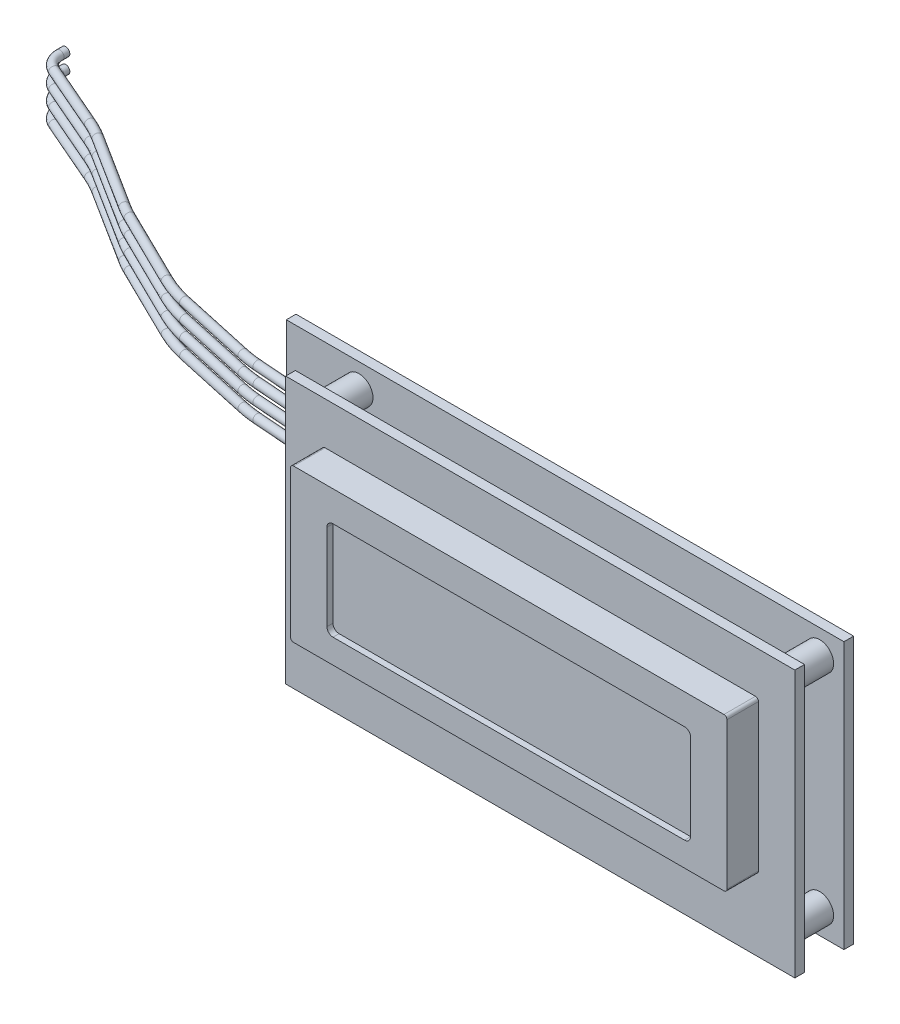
ISO-10303-21;
HEADER;
FILE_DESCRIPTION(('STEP AP214'),'2;1');
FILE_NAME('part.step','',(''),(''),'','','');
FILE_SCHEMA(('AUTOMOTIVE_DESIGN { 1 0 10303 214 1 1 1 1 }'));
ENDSEC;
DATA;
#1=APPLICATION_CONTEXT('core data for automotive mechanical design processes');
#2=APPLICATION_PROTOCOL_DEFINITION('international standard','automotive_design',2000,#1);
#3=PRODUCT_CONTEXT('',#1,'mechanical');
#4=PRODUCT('Part','Part','',(#3));
#5=PRODUCT_RELATED_PRODUCT_CATEGORY('part','',(#4));
#6=PRODUCT_DEFINITION_FORMATION('','',#4);
#7=PRODUCT_DEFINITION_CONTEXT('part definition',#1,'design');
#8=PRODUCT_DEFINITION('design','',#6,#7);
#9=PRODUCT_DEFINITION_SHAPE('','',#8);
#10=(LENGTH_UNIT() NAMED_UNIT(*) SI_UNIT(.MILLI.,.METRE.));
#11=(NAMED_UNIT(*) PLANE_ANGLE_UNIT() SI_UNIT($,.RADIAN.));
#12=(NAMED_UNIT(*) SI_UNIT($,.STERADIAN.) SOLID_ANGLE_UNIT());
#13=UNCERTAINTY_MEASURE_WITH_UNIT(LENGTH_MEASURE(1.E-05),#10,'distance_accuracy_value','');
#14=(GEOMETRIC_REPRESENTATION_CONTEXT(3) GLOBAL_UNCERTAINTY_ASSIGNED_CONTEXT((#13)) GLOBAL_UNIT_ASSIGNED_CONTEXT((#10,
#11,#12)) REPRESENTATION_CONTEXT('',''));
#15=CARTESIAN_POINT('',(0.,0.,0.));
#16=DIRECTION('',(0.,0.,1.));
#17=DIRECTION('',(1.,0.,0.));
#18=AXIS2_PLACEMENT_3D('',#15,#16,#17);
#19=CARTESIAN_POINT('',(0.,44.,0.));
#20=DIRECTION('',(0.,0.,-1.));
#21=DIRECTION('',(-1.,0.,0.));
#22=AXIS2_PLACEMENT_3D('',#19,#20,#21);
#23=PLANE('',#22);
#24=CARTESIAN_POINT('',(4.3,25.72,0.));
#25=DIRECTION('',(0.,0.,-1.));
#26=DIRECTION('',(-1.,0.,0.));
#27=AXIS2_PLACEMENT_3D('',#24,#25,#26);
#28=CIRCLE('',#27,0.7);
#29=CARTESIAN_POINT('',(3.6,25.72,0.));
#30=VERTEX_POINT('',#29);
#31=EDGE_CURVE('E761',#30,#30,#28,.T.);
#32=ORIENTED_EDGE('',*,*,#31,.F.);
#33=EDGE_LOOP('',(#32));
#34=FACE_BOUND('',#33,.T.);
#35=DIRECTION('',(0.,-1.,0.));
#36=VECTOR('',#35,1.);
#37=CARTESIAN_POINT('',(0.,0.,0.));
#38=LINE('',#37,#36);
#39=CARTESIAN_POINT('',(0.,44.,0.));
#40=VERTEX_POINT('',#39);
#41=CARTESIAN_POINT('',(0.,0.,0.));
#42=VERTEX_POINT('',#41);
#43=EDGE_CURVE('E364',#40,#42,#38,.T.);
#44=ORIENTED_EDGE('',*,*,#43,.F.);
#45=DIRECTION('',(-1.,0.,0.));
#46=VECTOR('',#45,1.);
#47=CARTESIAN_POINT('',(0.,44.,0.));
#48=LINE('',#47,#46);
#49=CARTESIAN_POINT('',(92.,44.,0.));
#50=VERTEX_POINT('',#49);
#51=EDGE_CURVE('E371',#50,#40,#48,.T.);
#52=ORIENTED_EDGE('',*,*,#51,.F.);
#53=DIRECTION('',(0.,1.,0.));
#54=VECTOR('',#53,1.);
#55=CARTESIAN_POINT('',(92.,0.,0.));
#56=LINE('',#55,#54);
#57=CARTESIAN_POINT('',(92.,0.,0.));
#58=VERTEX_POINT('',#57);
#59=EDGE_CURVE('E369',#58,#50,#56,.T.);
#60=ORIENTED_EDGE('',*,*,#59,.F.);
#61=DIRECTION('',(1.,0.,0.));
#62=VECTOR('',#61,1.);
#63=CARTESIAN_POINT('',(0.,0.,0.));
#64=LINE('',#63,#62);
#65=EDGE_CURVE('E367',#42,#58,#64,.T.);
#66=ORIENTED_EDGE('',*,*,#65,.F.);
#67=EDGE_LOOP('',(#44,#52,#60,#66));
#68=FACE_BOUND('',#67,.T.);
#69=CARTESIAN_POINT('',(4.3,30.8,0.));
#70=DIRECTION('',(0.,0.,-1.));
#71=DIRECTION('',(-1.,0.,0.));
#72=AXIS2_PLACEMENT_3D('',#69,#70,#71);
#73=CIRCLE('',#72,0.7);
#74=CARTESIAN_POINT('',(3.6,30.8,0.));
#75=VERTEX_POINT('',#74);
#76=EDGE_CURVE('E11',#75,#75,#73,.T.);
#77=ORIENTED_EDGE('',*,*,#76,.F.);
#78=EDGE_LOOP('',(#77));
#79=FACE_BOUND('',#78,.T.);
#80=CARTESIAN_POINT('',(4.3,28.26,0.));
#81=DIRECTION('',(0.,0.,-1.));
#82=DIRECTION('',(-1.,0.,0.));
#83=AXIS2_PLACEMENT_3D('',#80,#81,#82);
#84=CIRCLE('',#83,0.7);
#85=CARTESIAN_POINT('',(3.6,28.26,0.));
#86=VERTEX_POINT('',#85);
#87=EDGE_CURVE('E810',#86,#86,#84,.T.);
#88=ORIENTED_EDGE('',*,*,#87,.F.);
#89=EDGE_LOOP('',(#88));
#90=FACE_BOUND('',#89,.T.);
#91=CARTESIAN_POINT('',(4.3,23.18,0.));
#92=DIRECTION('',(0.,0.,-1.));
#93=DIRECTION('',(-1.,0.,0.));
#94=AXIS2_PLACEMENT_3D('',#91,#92,#93);
#95=CIRCLE('',#94,0.7);
#96=CARTESIAN_POINT('',(3.6,23.18,0.));
#97=VERTEX_POINT('',#96);
#98=EDGE_CURVE('E923',#97,#97,#95,.T.);
#99=ORIENTED_EDGE('',*,*,#98,.F.);
#100=EDGE_LOOP('',(#99));
#101=FACE_BOUND('',#100,.T.);
#102=ADVANCED_FACE('F31',(#34,#68,#79,#90,#101),#23,.T.);
#103=CARTESIAN_POINT('',(7.99999999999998,0.,9.7));
#104=DIRECTION('',(0.,0.,1.));
#105=DIRECTION('',(1.,0.,0.));
#106=AXIS2_PLACEMENT_3D('',#103,#104,#105);
#107=PLANE('',#106);
#108=DIRECTION('',(0.,-1.,0.));
#109=VECTOR('',#108,1.);
#110=CARTESIAN_POINT('',(7.99999999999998,44.,9.7));
#111=LINE('',#110,#109);
#112=CARTESIAN_POINT('',(7.99999999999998,44.,9.7));
#113=VERTEX_POINT('',#112);
#114=CARTESIAN_POINT('',(7.99999999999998,0.,9.7));
#115=VERTEX_POINT('',#114);
#116=EDGE_CURVE('E331',#113,#115,#111,.T.);
#117=ORIENTED_EDGE('',*,*,#116,.T.);
#118=DIRECTION('',(1.,0.,0.));
#119=VECTOR('',#118,1.);
#120=CARTESIAN_POINT('',(7.99999999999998,0.,9.7));
#121=LINE('',#120,#119);
#122=CARTESIAN_POINT('',(92.,0.,9.7));
#123=VERTEX_POINT('',#122);
#124=EDGE_CURVE('E334',#115,#123,#121,.T.);
#125=ORIENTED_EDGE('',*,*,#124,.T.);
#126=DIRECTION('',(0.,1.,0.));
#127=VECTOR('',#126,1.);
#128=CARTESIAN_POINT('',(92.,44.,9.7));
#129=LINE('',#128,#127);
#130=CARTESIAN_POINT('',(92.,44.,9.7));
#131=VERTEX_POINT('',#130);
#132=EDGE_CURVE('E336',#123,#131,#129,.T.);
#133=ORIENTED_EDGE('',*,*,#132,.T.);
#134=DIRECTION('',(-1.,0.,0.));
#135=VECTOR('',#134,1.);
#136=CARTESIAN_POINT('',(7.99999999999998,44.,9.7));
#137=LINE('',#136,#135);
#138=EDGE_CURVE('E338',#131,#113,#137,.T.);
#139=ORIENTED_EDGE('',*,*,#138,.T.);
#140=EDGE_LOOP('',(#117,#125,#133,#139));
#141=FACE_BOUND('',#140,.T.);
#142=DIRECTION('',(0.,-1.,0.));
#143=VECTOR('',#142,1.);
#144=CARTESIAN_POINT('',(14.,36.5,9.7));
#145=LINE('',#144,#143);
#146=CARTESIAN_POINT('',(14.,36.5,9.7));
#147=VERTEX_POINT('',#146);
#148=CARTESIAN_POINT('',(14.,12.3,9.7));
#149=VERTEX_POINT('',#148);
#150=EDGE_CURVE('E270',#147,#149,#145,.T.);
#151=ORIENTED_EDGE('',*,*,#150,.F.);
#152=CARTESIAN_POINT('',(14.5,36.5,9.7));
#153=DIRECTION('',(0.,0.,1.));
#154=DIRECTION('',(1.,0.,0.));
#155=AXIS2_PLACEMENT_3D('',#152,#153,#154);
#156=CIRCLE('',#155,0.5);
#157=CARTESIAN_POINT('',(14.5,37.,9.7));
#158=VERTEX_POINT('',#157);
#159=EDGE_CURVE('E257',#158,#147,#156,.T.);
#160=ORIENTED_EDGE('',*,*,#159,.F.);
#161=DIRECTION('',(-1.,0.,0.));
#162=VECTOR('',#161,1.);
#163=CARTESIAN_POINT('',(14.5,37.,9.7));
#164=LINE('',#163,#162);
#165=CARTESIAN_POINT('',(85.5,37.,9.7));
#166=VERTEX_POINT('',#165);
#167=EDGE_CURVE('E282',#166,#158,#164,.T.);
#168=ORIENTED_EDGE('',*,*,#167,.F.);
#169=CARTESIAN_POINT('',(85.5,36.5,9.7));
#170=DIRECTION('',(0.,0.,1.));
#171=DIRECTION('',(-1.,0.,0.));
#172=AXIS2_PLACEMENT_3D('',#169,#170,#171);
#173=CIRCLE('',#172,0.5);
#174=CARTESIAN_POINT('',(86.,36.5,9.7));
#175=VERTEX_POINT('',#174);
#176=EDGE_CURVE('E280',#175,#166,#173,.T.);
#177=ORIENTED_EDGE('',*,*,#176,.F.);
#178=DIRECTION('',(0.,1.,0.));
#179=VECTOR('',#178,1.);
#180=CARTESIAN_POINT('',(86.,36.5,9.7));
#181=LINE('',#180,#179);
#182=CARTESIAN_POINT('',(86.,12.3,9.7));
#183=VERTEX_POINT('',#182);
#184=EDGE_CURVE('E278',#183,#175,#181,.T.);
#185=ORIENTED_EDGE('',*,*,#184,.F.);
#186=CARTESIAN_POINT('',(85.5,12.3,9.7));
#187=DIRECTION('',(0.,0.,1.));
#188=DIRECTION('',(1.,0.,0.));
#189=AXIS2_PLACEMENT_3D('',#186,#187,#188);
#190=CIRCLE('',#189,0.5);
#191=CARTESIAN_POINT('',(85.5,11.8,9.7));
#192=VERTEX_POINT('',#191);
#193=EDGE_CURVE('E276',#192,#183,#190,.T.);
#194=ORIENTED_EDGE('',*,*,#193,.F.);
#195=DIRECTION('',(1.,0.,0.));
#196=VECTOR('',#195,1.);
#197=CARTESIAN_POINT('',(14.5,11.8,9.7));
#198=LINE('',#197,#196);
#199=CARTESIAN_POINT('',(14.5,11.8,9.7));
#200=VERTEX_POINT('',#199);
#201=EDGE_CURVE('E274',#200,#192,#198,.T.);
#202=ORIENTED_EDGE('',*,*,#201,.F.);
#203=CARTESIAN_POINT('',(14.5,12.3,9.7));
#204=DIRECTION('',(0.,0.,1.));
#205=DIRECTION('',(1.,0.,0.));
#206=AXIS2_PLACEMENT_3D('',#203,#204,#205);
#207=CIRCLE('',#206,0.5);
#208=EDGE_CURVE('E272',#149,#200,#207,.T.);
#209=ORIENTED_EDGE('',*,*,#208,.F.);
#210=EDGE_LOOP('',(#151,#160,#168,#177,#185,#194,#202,#209));
#211=FACE_BOUND('',#210,.T.);
#212=ADVANCED_FACE('F410',(#141,#211),#107,.T.);
#213=CARTESIAN_POINT('',(0.,44.,1.6));
#214=DIRECTION('',(0.,0.,-1.));
#215=DIRECTION('',(-1.,0.,0.));
#216=AXIS2_PLACEMENT_3D('',#213,#214,#215);
#217=PLANE('',#216);
#218=CARTESIAN_POINT('',(88.,40.,1.6));
#219=DIRECTION('',(0.,0.,-1.));
#220=DIRECTION('',(-1.,0.,0.));
#221=AXIS2_PLACEMENT_3D('',#218,#219,#220);
#222=CIRCLE('',#221,2.30000000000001);
#223=CARTESIAN_POINT('',(85.7,40.,1.6));
#224=VERTEX_POINT('',#223);
#225=EDGE_CURVE('E399',#224,#224,#222,.F.);
#226=ORIENTED_EDGE('',*,*,#225,.F.);
#227=EDGE_LOOP('',(#226));
#228=FACE_BOUND('',#227,.T.);
#229=CARTESIAN_POINT('',(12.,4.,1.6));
#230=DIRECTION('',(0.,0.,-1.));
#231=DIRECTION('',(-1.,0.,0.));
#232=AXIS2_PLACEMENT_3D('',#229,#230,#231);
#233=CIRCLE('',#232,2.3);
#234=CARTESIAN_POINT('',(9.69999999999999,4.,1.6));
#235=VERTEX_POINT('',#234);
#236=EDGE_CURVE('E394',#235,#235,#233,.F.);
#237=ORIENTED_EDGE('',*,*,#236,.F.);
#238=EDGE_LOOP('',(#237));
#239=FACE_BOUND('',#238,.T.);
#240=DIRECTION('',(0.,-1.,0.));
#241=VECTOR('',#240,1.);
#242=CARTESIAN_POINT('',(0.,0.,1.6));
#243=LINE('',#242,#241);
#244=CARTESIAN_POINT('',(0.,44.,1.6));
#245=VERTEX_POINT('',#244);
#246=CARTESIAN_POINT('',(0.,0.,1.6));
#247=VERTEX_POINT('',#246);
#248=EDGE_CURVE('E373',#245,#247,#243,.T.);
#249=ORIENTED_EDGE('',*,*,#248,.T.);
#250=DIRECTION('',(1.,0.,0.));
#251=VECTOR('',#250,1.);
#252=CARTESIAN_POINT('',(0.,0.,1.6));
#253=LINE('',#252,#251);
#254=CARTESIAN_POINT('',(92.,0.,1.6));
#255=VERTEX_POINT('',#254);
#256=EDGE_CURVE('E376',#247,#255,#253,.T.);
#257=ORIENTED_EDGE('',*,*,#256,.T.);
#258=DIRECTION('',(0.,1.,0.));
#259=VECTOR('',#258,1.);
#260=CARTESIAN_POINT('',(92.,0.,1.6));
#261=LINE('',#260,#259);
#262=CARTESIAN_POINT('',(92.,44.,1.6));
#263=VERTEX_POINT('',#262);
#264=EDGE_CURVE('E378',#255,#263,#261,.T.);
#265=ORIENTED_EDGE('',*,*,#264,.T.);
#266=DIRECTION('',(-1.,0.,0.));
#267=VECTOR('',#266,1.);
#268=CARTESIAN_POINT('',(0.,44.,1.6));
#269=LINE('',#268,#267);
#270=EDGE_CURVE('E380',#263,#245,#269,.T.);
#271=ORIENTED_EDGE('',*,*,#270,.T.);
#272=EDGE_LOOP('',(#249,#257,#265,#271));
#273=FACE_BOUND('',#272,.T.);
#274=CARTESIAN_POINT('',(88.,4.,1.6));
#275=DIRECTION('',(0.,0.,-1.));
#276=DIRECTION('',(-1.,0.,0.));
#277=AXIS2_PLACEMENT_3D('',#274,#275,#276);
#278=CIRCLE('',#277,2.30000000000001);
#279=CARTESIAN_POINT('',(85.7,4.,1.6));
#280=VERTEX_POINT('',#279);
#281=EDGE_CURVE('E397',#280,#280,#278,.F.);
#282=ORIENTED_EDGE('',*,*,#281,.F.);
#283=EDGE_LOOP('',(#282));
#284=FACE_BOUND('',#283,.T.);
#285=CARTESIAN_POINT('',(12.,40.,1.6));
#286=DIRECTION('',(0.,0.,-1.));
#287=DIRECTION('',(-1.,0.,0.));
#288=AXIS2_PLACEMENT_3D('',#285,#286,#287);
#289=CIRCLE('',#288,2.3);
#290=CARTESIAN_POINT('',(9.69999999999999,40.,1.6));
#291=VERTEX_POINT('',#290);
#292=EDGE_CURVE('E35',#291,#291,#289,.F.);
#293=ORIENTED_EDGE('',*,*,#292,.F.);
#294=EDGE_LOOP('',(#293));
#295=FACE_BOUND('',#294,.T.);
#296=ADVANCED_FACE('F408',(#228,#239,#273,#284,#295),#217,.F.);
#297=CARTESIAN_POINT('',(0.,0.,1.6));
#298=DIRECTION('',(1.,0.,0.));
#299=DIRECTION('',(0.,0.,-1.));
#300=AXIS2_PLACEMENT_3D('',#297,#298,#299);
#301=PLANE('',#300);
#302=ORIENTED_EDGE('',*,*,#43,.T.);
#303=DIRECTION('',(0.,0.,-1.));
#304=VECTOR('',#303,1.);
#305=CARTESIAN_POINT('',(0.,0.,1.6));
#306=LINE('',#305,#304);
#307=EDGE_CURVE('E391',#247,#42,#306,.T.);
#308=ORIENTED_EDGE('',*,*,#307,.F.);
#309=ORIENTED_EDGE('',*,*,#248,.F.);
#310=DIRECTION('',(0.,0.,-1.));
#311=VECTOR('',#310,1.);
#312=CARTESIAN_POINT('',(0.,44.,1.6));
#313=LINE('',#312,#311);
#314=EDGE_CURVE('E382',#245,#40,#313,.T.);
#315=ORIENTED_EDGE('',*,*,#314,.T.);
#316=EDGE_LOOP('',(#302,#308,#309,#315));
#317=FACE_BOUND('',#316,.T.);
#318=ADVANCED_FACE('F33',(#317),#301,.F.);
#319=CARTESIAN_POINT('',(0.,0.,1.6));
#320=DIRECTION('',(0.,1.,0.));
#321=DIRECTION('',(0.,0.,1.));
#322=AXIS2_PLACEMENT_3D('',#319,#320,#321);
#323=PLANE('',#322);
#324=ORIENTED_EDGE('',*,*,#65,.T.);
#325=DIRECTION('',(0.,0.,-1.));
#326=VECTOR('',#325,1.);
#327=CARTESIAN_POINT('',(92.,0.,1.6));
#328=LINE('',#327,#326);
#329=EDGE_CURVE('E388',#255,#58,#328,.T.);
#330=ORIENTED_EDGE('',*,*,#329,.F.);
#331=ORIENTED_EDGE('',*,*,#256,.F.);
#332=ORIENTED_EDGE('',*,*,#307,.T.);
#333=EDGE_LOOP('',(#324,#330,#331,#332));
#334=FACE_BOUND('',#333,.T.);
#335=ADVANCED_FACE('F418',(#334),#323,.F.);
#336=CARTESIAN_POINT('',(92.,0.,1.6));
#337=DIRECTION('',(-1.,0.,0.));
#338=DIRECTION('',(0.,0.,1.));
#339=AXIS2_PLACEMENT_3D('',#336,#337,#338);
#340=PLANE('',#339);
#341=ORIENTED_EDGE('',*,*,#59,.T.);
#342=DIRECTION('',(0.,0.,-1.));
#343=VECTOR('',#342,1.);
#344=CARTESIAN_POINT('',(92.,44.,1.6));
#345=LINE('',#344,#343);
#346=EDGE_CURVE('E385',#263,#50,#345,.T.);
#347=ORIENTED_EDGE('',*,*,#346,.F.);
#348=ORIENTED_EDGE('',*,*,#264,.F.);
#349=ORIENTED_EDGE('',*,*,#329,.T.);
#350=EDGE_LOOP('',(#341,#347,#348,#349));
#351=FACE_BOUND('',#350,.T.);
#352=ADVANCED_FACE('F1374',(#351),#340,.F.);
#353=CARTESIAN_POINT('',(0.,44.,1.6));
#354=DIRECTION('',(0.,-1.,0.));
#355=DIRECTION('',(0.,0.,-1.));
#356=AXIS2_PLACEMENT_3D('',#353,#354,#355);
#357=PLANE('',#356);
#358=ORIENTED_EDGE('',*,*,#51,.T.);
#359=ORIENTED_EDGE('',*,*,#314,.F.);
#360=ORIENTED_EDGE('',*,*,#270,.F.);
#361=ORIENTED_EDGE('',*,*,#346,.T.);
#362=EDGE_LOOP('',(#358,#359,#360,#361));
#363=FACE_BOUND('',#362,.T.);
#364=ADVANCED_FACE('F438',(#363),#357,.F.);
#365=CARTESIAN_POINT('',(12.,4.,8.1));
#366=DIRECTION('',(0.,0.,-1.));
#367=DIRECTION('',(-1.,0.,0.));
#368=AXIS2_PLACEMENT_3D('',#365,#366,#367);
#369=CYLINDRICAL_SURFACE('',#368,2.3);
#370=CARTESIAN_POINT('',(12.,4.,8.1));
#371=DIRECTION('',(0.,0.,1.));
#372=DIRECTION('',(1.,0.,0.));
#373=AXIS2_PLACEMENT_3D('',#370,#371,#372);
#374=CIRCLE('',#373,2.3);
#375=CARTESIAN_POINT('',(9.69999999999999,4.,8.1));
#376=VERTEX_POINT('',#375);
#377=EDGE_CURVE('E361',#376,#376,#374,.T.);
#378=CARTESIAN_POINT('',(9.69999999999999,4.,8.1));
#379=CARTESIAN_POINT('',(9.69999999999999,4.,8.03229166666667));
#380=CARTESIAN_POINT('',(9.69999999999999,4.,7.96458333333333));
#381=CARTESIAN_POINT('',(9.69999999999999,4.,7.82916666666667));
#382=CARTESIAN_POINT('',(9.69999999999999,4.,7.76145833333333));
#383=CARTESIAN_POINT('',(9.69999999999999,4.,7.62604166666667));
#384=CARTESIAN_POINT('',(9.69999999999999,4.,7.55833333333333));
#385=CARTESIAN_POINT('',(9.69999999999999,4.,7.42291666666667));
#386=CARTESIAN_POINT('',(9.69999999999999,4.,7.35520833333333));
#387=CARTESIAN_POINT('',(9.69999999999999,4.,7.21979166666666));
#388=CARTESIAN_POINT('',(9.69999999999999,4.,7.15208333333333));
#389=CARTESIAN_POINT('',(9.69999999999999,4.,7.01666666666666));
#390=CARTESIAN_POINT('',(9.69999999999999,4.,6.94895833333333));
#391=CARTESIAN_POINT('',(9.69999999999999,4.,6.81354166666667));
#392=CARTESIAN_POINT('',(9.69999999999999,4.,6.74583333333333));
#393=CARTESIAN_POINT('',(9.69999999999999,4.,6.61041666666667));
#394=CARTESIAN_POINT('',(9.69999999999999,4.,6.54270833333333));
#395=CARTESIAN_POINT('',(9.69999999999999,4.,6.40729166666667));
#396=CARTESIAN_POINT('',(9.69999999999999,4.,6.33958333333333));
#397=CARTESIAN_POINT('',(9.69999999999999,4.,6.20416666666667));
#398=CARTESIAN_POINT('',(9.69999999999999,4.,6.13645833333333));
#399=CARTESIAN_POINT('',(9.69999999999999,4.,6.00104166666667));
#400=CARTESIAN_POINT('',(9.69999999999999,4.,5.93333333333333));
#401=CARTESIAN_POINT('',(9.69999999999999,4.,5.79791666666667));
#402=CARTESIAN_POINT('',(9.69999999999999,4.,5.73020833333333));
#403=CARTESIAN_POINT('',(9.69999999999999,4.,5.59479166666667));
#404=CARTESIAN_POINT('',(9.69999999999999,4.,5.52708333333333));
#405=CARTESIAN_POINT('',(9.69999999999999,4.,5.39166666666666));
#406=CARTESIAN_POINT('',(9.69999999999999,4.,5.32395833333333));
#407=CARTESIAN_POINT('',(9.69999999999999,4.,5.18854166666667));
#408=CARTESIAN_POINT('',(9.69999999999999,4.,5.12083333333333));
#409=CARTESIAN_POINT('',(9.69999999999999,4.,4.98541666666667));
#410=CARTESIAN_POINT('',(9.69999999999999,4.,4.91770833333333));
#411=CARTESIAN_POINT('',(9.69999999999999,4.,4.78229166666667));
#412=CARTESIAN_POINT('',(9.69999999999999,4.,4.71458333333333));
#413=CARTESIAN_POINT('',(9.69999999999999,4.,4.57916666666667));
#414=CARTESIAN_POINT('',(9.69999999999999,4.,4.51145833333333));
#415=CARTESIAN_POINT('',(9.69999999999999,4.,4.37604166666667));
#416=CARTESIAN_POINT('',(9.69999999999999,4.,4.30833333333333));
#417=CARTESIAN_POINT('',(9.69999999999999,4.,4.17291666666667));
#418=CARTESIAN_POINT('',(9.69999999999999,4.,4.10520833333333));
#419=CARTESIAN_POINT('',(9.69999999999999,4.,3.96979166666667));
#420=CARTESIAN_POINT('',(9.69999999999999,4.,3.90208333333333));
#421=CARTESIAN_POINT('',(9.69999999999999,4.,3.76666666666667));
#422=CARTESIAN_POINT('',(9.69999999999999,4.,3.69895833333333));
#423=CARTESIAN_POINT('',(9.69999999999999,4.,3.56354166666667));
#424=CARTESIAN_POINT('',(9.69999999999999,4.,3.49583333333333));
#425=CARTESIAN_POINT('',(9.69999999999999,4.,3.36041666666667));
#426=CARTESIAN_POINT('',(9.69999999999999,4.,3.29270833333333));
#427=CARTESIAN_POINT('',(9.69999999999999,4.,3.15729166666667));
#428=CARTESIAN_POINT('',(9.69999999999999,4.,3.08958333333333));
#429=CARTESIAN_POINT('',(9.69999999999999,4.,2.95416666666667));
#430=CARTESIAN_POINT('',(9.69999999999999,4.,2.88645833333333));
#431=CARTESIAN_POINT('',(9.69999999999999,4.,2.75104166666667));
#432=CARTESIAN_POINT('',(9.69999999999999,4.,2.68333333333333));
#433=CARTESIAN_POINT('',(9.69999999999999,4.,2.54791666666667));
#434=CARTESIAN_POINT('',(9.69999999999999,4.,2.48020833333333));
#435=CARTESIAN_POINT('',(9.69999999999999,4.,2.34479166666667));
#436=CARTESIAN_POINT('',(9.69999999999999,4.,2.27708333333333));
#437=CARTESIAN_POINT('',(9.69999999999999,4.,2.14166666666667));
#438=CARTESIAN_POINT('',(9.69999999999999,4.,2.07395833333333));
#439=CARTESIAN_POINT('',(9.69999999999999,4.,1.93854166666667));
#440=CARTESIAN_POINT('',(9.69999999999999,4.,1.87083333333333));
#441=CARTESIAN_POINT('',(9.69999999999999,4.,1.73541666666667));
#442=CARTESIAN_POINT('',(9.69999999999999,4.,1.66770833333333));
#443=CARTESIAN_POINT('',(9.69999999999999,4.,1.6));
#444=B_SPLINE_CURVE_WITH_KNOTS('',3,(#378,#379,#380,#381,#382,#383,#384,#385,#386,#387,#388,
#389,#390,#391,#392,#393,#394,#395,#396,#397,#398,#399,#400,#401,#402,#403,#404,#405,#406,#407,
#408,#409,#410,#411,#412,#413,#414,#415,#416,#417,#418,#419,#420,#421,#422,#423,#424,#425,#426,
#427,#428,#429,#430,#431,#432,#433,#434,#435,#436,#437,#438,#439,#440,#441,#442,#443),
.UNSPECIFIED.,.F.,.F.,(4,2,2,2,2,2,2,2,2,2,2,2,2,2,2,2,2,2,2,2,2,2,2,2,2,2,2,2,2,2,2,2,4),(0.,
0.203125,0.40625,0.609375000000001,0.812500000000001,1.015625,1.21875,1.421875,1.625,1.828125,
2.03125,2.234375,2.4375,2.640625,2.84375,3.046875,3.25,3.453125,3.65625,3.859375,4.0625,
4.265625,4.46875,4.671875,4.875,5.078125,5.28125,5.484375,5.6875,5.890625,6.09375,6.296875,6.5),.UNSPECIFIED.);
#445=EDGE_CURVE('BSEAM435',#376,#235,#444,.T.);
#446=ORIENTED_EDGE('',*,*,#377,.F.);
#447=ORIENTED_EDGE('',*,*,#236,.T.);
#448=ORIENTED_EDGE('',*,*,#445,.T.);
#449=ORIENTED_EDGE('',*,*,#445,.F.);
#450=EDGE_LOOP('',(#446,#448,#447,#449));
#451=FACE_BOUND('',#450,.T.);
#452=ADVANCED_FACE('F435',(#451),#369,.T.);
#453=CARTESIAN_POINT('',(88.,4.,8.1));
#454=DIRECTION('',(0.,0.,-1.));
#455=DIRECTION('',(-1.,0.,0.));
#456=AXIS2_PLACEMENT_3D('',#453,#454,#455);
#457=CYLINDRICAL_SURFACE('',#456,2.30000000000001);
#458=CARTESIAN_POINT('',(88.,4.,8.1));
#459=DIRECTION('',(0.,0.,1.));
#460=DIRECTION('',(-1.,0.,0.));
#461=AXIS2_PLACEMENT_3D('',#458,#459,#460);
#462=CIRCLE('',#461,2.30000000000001);
#463=CARTESIAN_POINT('',(85.7,4.,8.1));
#464=VERTEX_POINT('',#463);
#465=EDGE_CURVE('E358',#464,#464,#462,.T.);
#466=CARTESIAN_POINT('',(85.7,4.,8.1));
#467=CARTESIAN_POINT('',(85.7,4.,8.03229166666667));
#468=CARTESIAN_POINT('',(85.7,4.,7.96458333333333));
#469=CARTESIAN_POINT('',(85.7,4.,7.82916666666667));
#470=CARTESIAN_POINT('',(85.7,4.,7.76145833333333));
#471=CARTESIAN_POINT('',(85.7,4.,7.62604166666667));
#472=CARTESIAN_POINT('',(85.7,4.,7.55833333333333));
#473=CARTESIAN_POINT('',(85.7,4.,7.42291666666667));
#474=CARTESIAN_POINT('',(85.7,4.,7.35520833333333));
#475=CARTESIAN_POINT('',(85.7,4.,7.21979166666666));
#476=CARTESIAN_POINT('',(85.7,4.,7.15208333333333));
#477=CARTESIAN_POINT('',(85.7,4.,7.01666666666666));
#478=CARTESIAN_POINT('',(85.7,4.,6.94895833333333));
#479=CARTESIAN_POINT('',(85.7,4.,6.81354166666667));
#480=CARTESIAN_POINT('',(85.7,4.,6.74583333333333));
#481=CARTESIAN_POINT('',(85.7,4.,6.61041666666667));
#482=CARTESIAN_POINT('',(85.7,4.,6.54270833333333));
#483=CARTESIAN_POINT('',(85.7,4.,6.40729166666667));
#484=CARTESIAN_POINT('',(85.7,4.,6.33958333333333));
#485=CARTESIAN_POINT('',(85.7,4.,6.20416666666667));
#486=CARTESIAN_POINT('',(85.7,4.,6.13645833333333));
#487=CARTESIAN_POINT('',(85.7,4.,6.00104166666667));
#488=CARTESIAN_POINT('',(85.7,4.,5.93333333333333));
#489=CARTESIAN_POINT('',(85.7,4.,5.79791666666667));
#490=CARTESIAN_POINT('',(85.7,4.,5.73020833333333));
#491=CARTESIAN_POINT('',(85.7,4.,5.59479166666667));
#492=CARTESIAN_POINT('',(85.7,4.,5.52708333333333));
#493=CARTESIAN_POINT('',(85.7,4.,5.39166666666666));
#494=CARTESIAN_POINT('',(85.7,4.,5.32395833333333));
#495=CARTESIAN_POINT('',(85.7,4.,5.18854166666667));
#496=CARTESIAN_POINT('',(85.7,4.,5.12083333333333));
#497=CARTESIAN_POINT('',(85.7,4.,4.98541666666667));
#498=CARTESIAN_POINT('',(85.7,4.,4.91770833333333));
#499=CARTESIAN_POINT('',(85.7,4.,4.78229166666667));
#500=CARTESIAN_POINT('',(85.7,4.,4.71458333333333));
#501=CARTESIAN_POINT('',(85.7,4.,4.57916666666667));
#502=CARTESIAN_POINT('',(85.7,4.,4.51145833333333));
#503=CARTESIAN_POINT('',(85.7,4.,4.37604166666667));
#504=CARTESIAN_POINT('',(85.7,4.,4.30833333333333));
#505=CARTESIAN_POINT('',(85.7,4.,4.17291666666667));
#506=CARTESIAN_POINT('',(85.7,4.,4.10520833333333));
#507=CARTESIAN_POINT('',(85.7,4.,3.96979166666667));
#508=CARTESIAN_POINT('',(85.7,4.,3.90208333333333));
#509=CARTESIAN_POINT('',(85.7,4.,3.76666666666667));
#510=CARTESIAN_POINT('',(85.7,4.,3.69895833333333));
#511=CARTESIAN_POINT('',(85.7,4.,3.56354166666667));
#512=CARTESIAN_POINT('',(85.7,4.,3.49583333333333));
#513=CARTESIAN_POINT('',(85.7,4.,3.36041666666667));
#514=CARTESIAN_POINT('',(85.7,4.,3.29270833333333));
#515=CARTESIAN_POINT('',(85.7,4.,3.15729166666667));
#516=CARTESIAN_POINT('',(85.7,4.,3.08958333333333));
#517=CARTESIAN_POINT('',(85.7,4.,2.95416666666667));
#518=CARTESIAN_POINT('',(85.7,4.,2.88645833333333));
#519=CARTESIAN_POINT('',(85.7,4.,2.75104166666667));
#520=CARTESIAN_POINT('',(85.7,4.,2.68333333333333));
#521=CARTESIAN_POINT('',(85.7,4.,2.54791666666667));
#522=CARTESIAN_POINT('',(85.7,4.,2.48020833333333));
#523=CARTESIAN_POINT('',(85.7,4.,2.34479166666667));
#524=CARTESIAN_POINT('',(85.7,4.,2.27708333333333));
#525=CARTESIAN_POINT('',(85.7,4.,2.14166666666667));
#526=CARTESIAN_POINT('',(85.7,4.,2.07395833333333));
#527=CARTESIAN_POINT('',(85.7,4.,1.93854166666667));
#528=CARTESIAN_POINT('',(85.7,4.,1.87083333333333));
#529=CARTESIAN_POINT('',(85.7,4.,1.73541666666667));
#530=CARTESIAN_POINT('',(85.7,4.,1.66770833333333));
#531=CARTESIAN_POINT('',(85.7,4.,1.6));
#532=B_SPLINE_CURVE_WITH_KNOTS('',3,(#466,#467,#468,#469,#470,#471,#472,#473,#474,#475,#476,
#477,#478,#479,#480,#481,#482,#483,#484,#485,#486,#487,#488,#489,#490,#491,#492,#493,#494,#495,
#496,#497,#498,#499,#500,#501,#502,#503,#504,#505,#506,#507,#508,#509,#510,#511,#512,#513,#514,
#515,#516,#517,#518,#519,#520,#521,#522,#523,#524,#525,#526,#527,#528,#529,#530,#531),
.UNSPECIFIED.,.F.,.F.,(4,2,2,2,2,2,2,2,2,2,2,2,2,2,2,2,2,2,2,2,2,2,2,2,2,2,2,2,2,2,2,2,4),(0.,
0.203125,0.40625,0.609375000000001,0.812500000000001,1.015625,1.21875,1.421875,1.625,1.828125,
2.03125,2.234375,2.4375,2.640625,2.84375,3.046875,3.25,3.453125,3.65625,3.859375,4.0625,
4.265625,4.46875,4.671875,4.875,5.078125,5.28125,5.484375,5.6875,5.890625,6.09375,6.296875,6.5),.UNSPECIFIED.);
#533=EDGE_CURVE('BSEAM437',#464,#280,#532,.T.);
#534=ORIENTED_EDGE('',*,*,#465,.F.);
#535=ORIENTED_EDGE('',*,*,#281,.T.);
#536=ORIENTED_EDGE('',*,*,#533,.T.);
#537=ORIENTED_EDGE('',*,*,#533,.F.);
#538=EDGE_LOOP('',(#534,#536,#535,#537));
#539=FACE_BOUND('',#538,.T.);
#540=ADVANCED_FACE('F437',(#539),#457,.T.);
#541=CARTESIAN_POINT('',(88.,40.,8.1));
#542=DIRECTION('',(0.,0.,-1.));
#543=DIRECTION('',(-1.,0.,0.));
#544=AXIS2_PLACEMENT_3D('',#541,#542,#543);
#545=CYLINDRICAL_SURFACE('',#544,2.30000000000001);
#546=CARTESIAN_POINT('',(88.,40.,8.1));
#547=DIRECTION('',(0.,0.,1.));
#548=DIRECTION('',(1.,0.,0.));
#549=AXIS2_PLACEMENT_3D('',#546,#547,#548);
#550=CIRCLE('',#549,2.30000000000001);
#551=CARTESIAN_POINT('',(85.7,40.,8.1));
#552=VERTEX_POINT('',#551);
#553=EDGE_CURVE('E355',#552,#552,#550,.T.);
#554=CARTESIAN_POINT('',(85.7,40.,8.1));
#555=CARTESIAN_POINT('',(85.7,40.,8.03229166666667));
#556=CARTESIAN_POINT('',(85.7,40.,7.96458333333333));
#557=CARTESIAN_POINT('',(85.7,40.,7.82916666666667));
#558=CARTESIAN_POINT('',(85.7,40.,7.76145833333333));
#559=CARTESIAN_POINT('',(85.7,40.,7.62604166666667));
#560=CARTESIAN_POINT('',(85.7,40.,7.55833333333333));
#561=CARTESIAN_POINT('',(85.7,40.,7.42291666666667));
#562=CARTESIAN_POINT('',(85.7,40.,7.35520833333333));
#563=CARTESIAN_POINT('',(85.7,40.,7.21979166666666));
#564=CARTESIAN_POINT('',(85.7,40.,7.15208333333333));
#565=CARTESIAN_POINT('',(85.7,40.,7.01666666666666));
#566=CARTESIAN_POINT('',(85.7,40.,6.94895833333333));
#567=CARTESIAN_POINT('',(85.7,40.,6.81354166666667));
#568=CARTESIAN_POINT('',(85.7,40.,6.74583333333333));
#569=CARTESIAN_POINT('',(85.7,40.,6.61041666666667));
#570=CARTESIAN_POINT('',(85.7,40.,6.54270833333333));
#571=CARTESIAN_POINT('',(85.7,40.,6.40729166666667));
#572=CARTESIAN_POINT('',(85.7,40.,6.33958333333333));
#573=CARTESIAN_POINT('',(85.7,40.,6.20416666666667));
#574=CARTESIAN_POINT('',(85.7,40.,6.13645833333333));
#575=CARTESIAN_POINT('',(85.7,40.,6.00104166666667));
#576=CARTESIAN_POINT('',(85.7,40.,5.93333333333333));
#577=CARTESIAN_POINT('',(85.7,40.,5.79791666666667));
#578=CARTESIAN_POINT('',(85.7,40.,5.73020833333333));
#579=CARTESIAN_POINT('',(85.7,40.,5.59479166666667));
#580=CARTESIAN_POINT('',(85.7,40.,5.52708333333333));
#581=CARTESIAN_POINT('',(85.7,40.,5.39166666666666));
#582=CARTESIAN_POINT('',(85.7,40.,5.32395833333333));
#583=CARTESIAN_POINT('',(85.7,40.,5.18854166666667));
#584=CARTESIAN_POINT('',(85.7,40.,5.12083333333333));
#585=CARTESIAN_POINT('',(85.7,40.,4.98541666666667));
#586=CARTESIAN_POINT('',(85.7,40.,4.91770833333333));
#587=CARTESIAN_POINT('',(85.7,40.,4.78229166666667));
#588=CARTESIAN_POINT('',(85.7,40.,4.71458333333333));
#589=CARTESIAN_POINT('',(85.7,40.,4.57916666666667));
#590=CARTESIAN_POINT('',(85.7,40.,4.51145833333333));
#591=CARTESIAN_POINT('',(85.7,40.,4.37604166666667));
#592=CARTESIAN_POINT('',(85.7,40.,4.30833333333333));
#593=CARTESIAN_POINT('',(85.7,40.,4.17291666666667));
#594=CARTESIAN_POINT('',(85.7,40.,4.10520833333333));
#595=CARTESIAN_POINT('',(85.7,40.,3.96979166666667));
#596=CARTESIAN_POINT('',(85.7,40.,3.90208333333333));
#597=CARTESIAN_POINT('',(85.7,40.,3.76666666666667));
#598=CARTESIAN_POINT('',(85.7,40.,3.69895833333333));
#599=CARTESIAN_POINT('',(85.7,40.,3.56354166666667));
#600=CARTESIAN_POINT('',(85.7,40.,3.49583333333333));
#601=CARTESIAN_POINT('',(85.7,40.,3.36041666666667));
#602=CARTESIAN_POINT('',(85.7,40.,3.29270833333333));
#603=CARTESIAN_POINT('',(85.7,40.,3.15729166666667));
#604=CARTESIAN_POINT('',(85.7,40.,3.08958333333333));
#605=CARTESIAN_POINT('',(85.7,40.,2.95416666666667));
#606=CARTESIAN_POINT('',(85.7,40.,2.88645833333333));
#607=CARTESIAN_POINT('',(85.7,40.,2.75104166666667));
#608=CARTESIAN_POINT('',(85.7,40.,2.68333333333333));
#609=CARTESIAN_POINT('',(85.7,40.,2.54791666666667));
#610=CARTESIAN_POINT('',(85.7,40.,2.48020833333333));
#611=CARTESIAN_POINT('',(85.7,40.,2.34479166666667));
#612=CARTESIAN_POINT('',(85.7,40.,2.27708333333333));
#613=CARTESIAN_POINT('',(85.7,40.,2.14166666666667));
#614=CARTESIAN_POINT('',(85.7,40.,2.07395833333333));
#615=CARTESIAN_POINT('',(85.7,40.,1.93854166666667));
#616=CARTESIAN_POINT('',(85.7,40.,1.87083333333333));
#617=CARTESIAN_POINT('',(85.7,40.,1.73541666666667));
#618=CARTESIAN_POINT('',(85.7,40.,1.66770833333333));
#619=CARTESIAN_POINT('',(85.7,40.,1.6));
#620=B_SPLINE_CURVE_WITH_KNOTS('',3,(#554,#555,#556,#557,#558,#559,#560,#561,#562,#563,#564,
#565,#566,#567,#568,#569,#570,#571,#572,#573,#574,#575,#576,#577,#578,#579,#580,#581,#582,#583,
#584,#585,#586,#587,#588,#589,#590,#591,#592,#593,#594,#595,#596,#597,#598,#599,#600,#601,#602,
#603,#604,#605,#606,#607,#608,#609,#610,#611,#612,#613,#614,#615,#616,#617,#618,#619),
.UNSPECIFIED.,.F.,.F.,(4,2,2,2,2,2,2,2,2,2,2,2,2,2,2,2,2,2,2,2,2,2,2,2,2,2,2,2,2,2,2,2,4),(0.,
0.203125,0.40625,0.609375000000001,0.812500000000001,1.015625,1.21875,1.421875,1.625,1.828125,
2.03125,2.234375,2.4375,2.640625,2.84375,3.046875,3.25,3.453125,3.65625,3.859375,4.0625,
4.265625,4.46875,4.671875,4.875,5.078125,5.28125,5.484375,5.6875,5.890625,6.09375,6.296875,6.5),.UNSPECIFIED.);
#621=EDGE_CURVE('BSEAM442',#552,#224,#620,.T.);
#622=ORIENTED_EDGE('',*,*,#553,.F.);
#623=ORIENTED_EDGE('',*,*,#225,.T.);
#624=ORIENTED_EDGE('',*,*,#621,.T.);
#625=ORIENTED_EDGE('',*,*,#621,.F.);
#626=EDGE_LOOP('',(#622,#624,#623,#625));
#627=FACE_BOUND('',#626,.T.);
#628=ADVANCED_FACE('F442',(#627),#545,.T.);
#629=CARTESIAN_POINT('',(12.,40.,8.1));
#630=DIRECTION('',(0.,0.,-1.));
#631=DIRECTION('',(-1.,0.,0.));
#632=AXIS2_PLACEMENT_3D('',#629,#630,#631);
#633=CYLINDRICAL_SURFACE('',#632,2.3);
#634=CARTESIAN_POINT('',(12.,40.,8.1));
#635=DIRECTION('',(0.,0.,1.));
#636=DIRECTION('',(-1.,0.,0.));
#637=AXIS2_PLACEMENT_3D('',#634,#635,#636);
#638=CIRCLE('',#637,2.3);
#639=CARTESIAN_POINT('',(9.69999999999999,40.,8.1));
#640=VERTEX_POINT('',#639);
#641=EDGE_CURVE('E352',#640,#640,#638,.T.);
#642=CARTESIAN_POINT('',(9.69999999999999,40.,8.1));
#643=CARTESIAN_POINT('',(9.69999999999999,40.,8.03229166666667));
#644=CARTESIAN_POINT('',(9.69999999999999,40.,7.96458333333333));
#645=CARTESIAN_POINT('',(9.69999999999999,40.,7.82916666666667));
#646=CARTESIAN_POINT('',(9.69999999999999,40.,7.76145833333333));
#647=CARTESIAN_POINT('',(9.69999999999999,40.,7.62604166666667));
#648=CARTESIAN_POINT('',(9.69999999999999,40.,7.55833333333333));
#649=CARTESIAN_POINT('',(9.69999999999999,40.,7.42291666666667));
#650=CARTESIAN_POINT('',(9.69999999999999,40.,7.35520833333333));
#651=CARTESIAN_POINT('',(9.69999999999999,40.,7.21979166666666));
#652=CARTESIAN_POINT('',(9.69999999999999,40.,7.15208333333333));
#653=CARTESIAN_POINT('',(9.69999999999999,40.,7.01666666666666));
#654=CARTESIAN_POINT('',(9.69999999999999,40.,6.94895833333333));
#655=CARTESIAN_POINT('',(9.69999999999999,40.,6.81354166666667));
#656=CARTESIAN_POINT('',(9.69999999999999,40.,6.74583333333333));
#657=CARTESIAN_POINT('',(9.69999999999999,40.,6.61041666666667));
#658=CARTESIAN_POINT('',(9.69999999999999,40.,6.54270833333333));
#659=CARTESIAN_POINT('',(9.69999999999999,40.,6.40729166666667));
#660=CARTESIAN_POINT('',(9.69999999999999,40.,6.33958333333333));
#661=CARTESIAN_POINT('',(9.69999999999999,40.,6.20416666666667));
#662=CARTESIAN_POINT('',(9.69999999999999,40.,6.13645833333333));
#663=CARTESIAN_POINT('',(9.69999999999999,40.,6.00104166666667));
#664=CARTESIAN_POINT('',(9.69999999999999,40.,5.93333333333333));
#665=CARTESIAN_POINT('',(9.69999999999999,40.,5.79791666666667));
#666=CARTESIAN_POINT('',(9.69999999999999,40.,5.73020833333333));
#667=CARTESIAN_POINT('',(9.69999999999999,40.,5.59479166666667));
#668=CARTESIAN_POINT('',(9.69999999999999,40.,5.52708333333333));
#669=CARTESIAN_POINT('',(9.69999999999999,40.,5.39166666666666));
#670=CARTESIAN_POINT('',(9.69999999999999,40.,5.32395833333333));
#671=CARTESIAN_POINT('',(9.69999999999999,40.,5.18854166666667));
#672=CARTESIAN_POINT('',(9.69999999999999,40.,5.12083333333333));
#673=CARTESIAN_POINT('',(9.69999999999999,40.,4.98541666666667));
#674=CARTESIAN_POINT('',(9.69999999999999,40.,4.91770833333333));
#675=CARTESIAN_POINT('',(9.69999999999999,40.,4.78229166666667));
#676=CARTESIAN_POINT('',(9.69999999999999,40.,4.71458333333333));
#677=CARTESIAN_POINT('',(9.69999999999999,40.,4.57916666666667));
#678=CARTESIAN_POINT('',(9.69999999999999,40.,4.51145833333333));
#679=CARTESIAN_POINT('',(9.69999999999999,40.,4.37604166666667));
#680=CARTESIAN_POINT('',(9.69999999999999,40.,4.30833333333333));
#681=CARTESIAN_POINT('',(9.69999999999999,40.,4.17291666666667));
#682=CARTESIAN_POINT('',(9.69999999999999,40.,4.10520833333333));
#683=CARTESIAN_POINT('',(9.69999999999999,40.,3.96979166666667));
#684=CARTESIAN_POINT('',(9.69999999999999,40.,3.90208333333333));
#685=CARTESIAN_POINT('',(9.69999999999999,40.,3.76666666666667));
#686=CARTESIAN_POINT('',(9.69999999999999,40.,3.69895833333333));
#687=CARTESIAN_POINT('',(9.69999999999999,40.,3.56354166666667));
#688=CARTESIAN_POINT('',(9.69999999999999,40.,3.49583333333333));
#689=CARTESIAN_POINT('',(9.69999999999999,40.,3.36041666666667));
#690=CARTESIAN_POINT('',(9.69999999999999,40.,3.29270833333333));
#691=CARTESIAN_POINT('',(9.69999999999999,40.,3.15729166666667));
#692=CARTESIAN_POINT('',(9.69999999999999,40.,3.08958333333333));
#693=CARTESIAN_POINT('',(9.69999999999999,40.,2.95416666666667));
#694=CARTESIAN_POINT('',(9.69999999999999,40.,2.88645833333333));
#695=CARTESIAN_POINT('',(9.69999999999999,40.,2.75104166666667));
#696=CARTESIAN_POINT('',(9.69999999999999,40.,2.68333333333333));
#697=CARTESIAN_POINT('',(9.69999999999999,40.,2.54791666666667));
#698=CARTESIAN_POINT('',(9.69999999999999,40.,2.48020833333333));
#699=CARTESIAN_POINT('',(9.69999999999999,40.,2.34479166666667));
#700=CARTESIAN_POINT('',(9.69999999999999,40.,2.27708333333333));
#701=CARTESIAN_POINT('',(9.69999999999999,40.,2.14166666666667));
#702=CARTESIAN_POINT('',(9.69999999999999,40.,2.07395833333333));
#703=CARTESIAN_POINT('',(9.69999999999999,40.,1.93854166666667));
#704=CARTESIAN_POINT('',(9.69999999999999,40.,1.87083333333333));
#705=CARTESIAN_POINT('',(9.69999999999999,40.,1.73541666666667));
#706=CARTESIAN_POINT('',(9.69999999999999,40.,1.66770833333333));
#707=CARTESIAN_POINT('',(9.69999999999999,40.,1.6));
#708=B_SPLINE_CURVE_WITH_KNOTS('',3,(#642,#643,#644,#645,#646,#647,#648,#649,#650,#651,#652,
#653,#654,#655,#656,#657,#658,#659,#660,#661,#662,#663,#664,#665,#666,#667,#668,#669,#670,#671,
#672,#673,#674,#675,#676,#677,#678,#679,#680,#681,#682,#683,#684,#685,#686,#687,#688,#689,#690,
#691,#692,#693,#694,#695,#696,#697,#698,#699,#700,#701,#702,#703,#704,#705,#706,#707),
.UNSPECIFIED.,.F.,.F.,(4,2,2,2,2,2,2,2,2,2,2,2,2,2,2,2,2,2,2,2,2,2,2,2,2,2,2,2,2,2,2,2,4),(0.,
0.203125,0.40625,0.609375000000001,0.812500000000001,1.015625,1.21875,1.421875,1.625,1.828125,
2.03125,2.234375,2.4375,2.640625,2.84375,3.046875,3.25,3.453125,3.65625,3.859375,4.0625,
4.265625,4.46875,4.671875,4.875,5.078125,5.28125,5.484375,5.6875,5.890625,6.09375,6.296875,6.5),.UNSPECIFIED.);
#709=EDGE_CURVE('BSEAM406',#640,#291,#708,.T.);
#710=ORIENTED_EDGE('',*,*,#641,.F.);
#711=ORIENTED_EDGE('',*,*,#292,.T.);
#712=ORIENTED_EDGE('',*,*,#709,.T.);
#713=ORIENTED_EDGE('',*,*,#709,.F.);
#714=EDGE_LOOP('',(#710,#712,#711,#713));
#715=FACE_BOUND('',#714,.T.);
#716=ADVANCED_FACE('F406',(#715),#633,.T.);
#717=CARTESIAN_POINT('',(7.99999999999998,0.,8.1));
#718=DIRECTION('',(0.,0.,1.));
#719=DIRECTION('',(1.,0.,0.));
#720=AXIS2_PLACEMENT_3D('',#717,#718,#719);
#721=PLANE('',#720);
#722=ORIENTED_EDGE('',*,*,#465,.T.);
#723=EDGE_LOOP('',(#722));
#724=FACE_BOUND('',#723,.T.);
#725=ORIENTED_EDGE('',*,*,#641,.T.);
#726=EDGE_LOOP('',(#725));
#727=FACE_BOUND('',#726,.T.);
#728=DIRECTION('',(0.,-1.,0.));
#729=VECTOR('',#728,1.);
#730=CARTESIAN_POINT('',(7.99999999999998,44.,8.1));
#731=LINE('',#730,#729);
#732=CARTESIAN_POINT('',(7.99999999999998,44.,8.1));
#733=VERTEX_POINT('',#732);
#734=CARTESIAN_POINT('',(7.99999999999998,0.,8.1));
#735=VERTEX_POINT('',#734);
#736=EDGE_CURVE('E322',#733,#735,#731,.T.);
#737=ORIENTED_EDGE('',*,*,#736,.F.);
#738=DIRECTION('',(-1.,0.,0.));
#739=VECTOR('',#738,1.);
#740=CARTESIAN_POINT('',(7.99999999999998,44.,8.1));
#741=LINE('',#740,#739);
#742=CARTESIAN_POINT('',(92.,44.,8.1));
#743=VERTEX_POINT('',#742);
#744=EDGE_CURVE('E329',#743,#733,#741,.T.);
#745=ORIENTED_EDGE('',*,*,#744,.F.);
#746=DIRECTION('',(0.,1.,0.));
#747=VECTOR('',#746,1.);
#748=CARTESIAN_POINT('',(92.,44.,8.1));
#749=LINE('',#748,#747);
#750=CARTESIAN_POINT('',(92.,0.,8.1));
#751=VERTEX_POINT('',#750);
#752=EDGE_CURVE('E327',#751,#743,#749,.T.);
#753=ORIENTED_EDGE('',*,*,#752,.F.);
#754=DIRECTION('',(1.,0.,0.));
#755=VECTOR('',#754,1.);
#756=CARTESIAN_POINT('',(7.99999999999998,0.,8.1));
#757=LINE('',#756,#755);
#758=EDGE_CURVE('E325',#735,#751,#757,.T.);
#759=ORIENTED_EDGE('',*,*,#758,.F.);
#760=EDGE_LOOP('',(#737,#745,#753,#759));
#761=FACE_BOUND('',#760,.T.);
#762=ORIENTED_EDGE('',*,*,#553,.T.);
#763=EDGE_LOOP('',(#762));
#764=FACE_BOUND('',#763,.T.);
#765=ORIENTED_EDGE('',*,*,#377,.T.);
#766=EDGE_LOOP('',(#765));
#767=FACE_BOUND('',#766,.T.);
#768=ADVANCED_FACE('F449',(#724,#727,#761,#764,#767),#721,.F.);
#769=CARTESIAN_POINT('',(7.99999999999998,44.,9.7));
#770=DIRECTION('',(1.,0.,0.));
#771=DIRECTION('',(0.,0.,-1.));
#772=AXIS2_PLACEMENT_3D('',#769,#770,#771);
#773=PLANE('',#772);
#774=ORIENTED_EDGE('',*,*,#736,.T.);
#775=DIRECTION('',(0.,0.,-1.));
#776=VECTOR('',#775,1.);
#777=CARTESIAN_POINT('',(7.99999999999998,0.,9.7));
#778=LINE('',#777,#776);
#779=EDGE_CURVE('E349',#115,#735,#778,.T.);
#780=ORIENTED_EDGE('',*,*,#779,.F.);
#781=ORIENTED_EDGE('',*,*,#116,.F.);
#782=DIRECTION('',(0.,0.,-1.));
#783=VECTOR('',#782,1.);
#784=CARTESIAN_POINT('',(7.99999999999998,44.,9.7));
#785=LINE('',#784,#783);
#786=EDGE_CURVE('E340',#113,#733,#785,.T.);
#787=ORIENTED_EDGE('',*,*,#786,.T.);
#788=EDGE_LOOP('',(#774,#780,#781,#787));
#789=FACE_BOUND('',#788,.T.);
#790=ADVANCED_FACE('F451',(#789),#773,.F.);
#791=CARTESIAN_POINT('',(7.99999999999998,0.,9.7));
#792=DIRECTION('',(0.,1.,0.));
#793=DIRECTION('',(0.,0.,1.));
#794=AXIS2_PLACEMENT_3D('',#791,#792,#793);
#795=PLANE('',#794);
#796=ORIENTED_EDGE('',*,*,#758,.T.);
#797=DIRECTION('',(0.,0.,-1.));
#798=VECTOR('',#797,1.);
#799=CARTESIAN_POINT('',(92.,0.,9.7));
#800=LINE('',#799,#798);
#801=EDGE_CURVE('E346',#123,#751,#800,.T.);
#802=ORIENTED_EDGE('',*,*,#801,.F.);
#803=ORIENTED_EDGE('',*,*,#124,.F.);
#804=ORIENTED_EDGE('',*,*,#779,.T.);
#805=EDGE_LOOP('',(#796,#802,#803,#804));
#806=FACE_BOUND('',#805,.T.);
#807=ADVANCED_FACE('F454',(#806),#795,.F.);
#808=CARTESIAN_POINT('',(92.,44.,9.7));
#809=DIRECTION('',(-1.,0.,0.));
#810=DIRECTION('',(0.,0.,1.));
#811=AXIS2_PLACEMENT_3D('',#808,#809,#810);
#812=PLANE('',#811);
#813=ORIENTED_EDGE('',*,*,#752,.T.);
#814=DIRECTION('',(0.,0.,-1.));
#815=VECTOR('',#814,1.);
#816=CARTESIAN_POINT('',(92.,44.,9.7));
#817=LINE('',#816,#815);
#818=EDGE_CURVE('E343',#131,#743,#817,.T.);
#819=ORIENTED_EDGE('',*,*,#818,.F.);
#820=ORIENTED_EDGE('',*,*,#132,.F.);
#821=ORIENTED_EDGE('',*,*,#801,.T.);
#822=EDGE_LOOP('',(#813,#819,#820,#821));
#823=FACE_BOUND('',#822,.T.);
#824=ADVANCED_FACE('F458',(#823),#812,.F.);
#825=CARTESIAN_POINT('',(7.99999999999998,44.,9.7));
#826=DIRECTION('',(0.,-1.,0.));
#827=DIRECTION('',(0.,0.,-1.));
#828=AXIS2_PLACEMENT_3D('',#825,#826,#827);
#829=PLANE('',#828);
#830=ORIENTED_EDGE('',*,*,#744,.T.);
#831=ORIENTED_EDGE('',*,*,#786,.F.);
#832=ORIENTED_EDGE('',*,*,#138,.F.);
#833=ORIENTED_EDGE('',*,*,#818,.T.);
#834=EDGE_LOOP('',(#830,#831,#832,#833));
#835=FACE_BOUND('',#834,.T.);
#836=ADVANCED_FACE('F462',(#835),#829,.F.);
#837=CARTESIAN_POINT('',(14.5,36.5,14.9));
#838=DIRECTION('',(0.,0.,-1.));
#839=DIRECTION('',(-1.,0.,0.));
#840=AXIS2_PLACEMENT_3D('',#837,#838,#839);
#841=CYLINDRICAL_SURFACE('',#840,0.5);
#842=ORIENTED_EDGE('',*,*,#159,.T.);
#843=DIRECTION('',(0.,0.,-1.));
#844=VECTOR('',#843,1.);
#845=CARTESIAN_POINT('',(14.,36.5,14.9));
#846=LINE('',#845,#844);
#847=CARTESIAN_POINT('',(14.,36.5,14.9));
#848=VERTEX_POINT('',#847);
#849=EDGE_CURVE('E320',#848,#147,#846,.T.);
#850=ORIENTED_EDGE('',*,*,#849,.F.);
#851=CARTESIAN_POINT('',(14.5,36.5,14.9));
#852=DIRECTION('',(0.,0.,1.));
#853=DIRECTION('',(1.,0.,0.));
#854=AXIS2_PLACEMENT_3D('',#851,#852,#853);
#855=CIRCLE('',#854,0.5);
#856=CARTESIAN_POINT('',(14.5,37.,14.9));
#857=VERTEX_POINT('',#856);
#858=EDGE_CURVE('E284',#857,#848,#855,.T.);
#859=ORIENTED_EDGE('',*,*,#858,.F.);
#860=DIRECTION('',(0.,0.,-1.));
#861=VECTOR('',#860,1.);
#862=CARTESIAN_POINT('',(14.5,37.,14.9));
#863=LINE('',#862,#861);
#864=EDGE_CURVE('E301',#857,#158,#863,.T.);
#865=ORIENTED_EDGE('',*,*,#864,.T.);
#866=EDGE_LOOP('',(#842,#850,#859,#865));
#867=FACE_BOUND('',#866,.T.);
#868=ADVANCED_FACE('F465',(#867),#841,.T.);
#869=CARTESIAN_POINT('',(14.,36.5,14.9));
#870=DIRECTION('',(1.,0.,0.));
#871=DIRECTION('',(0.,0.,-1.));
#872=AXIS2_PLACEMENT_3D('',#869,#870,#871);
#873=PLANE('',#872);
#874=ORIENTED_EDGE('',*,*,#150,.T.);
#875=DIRECTION('',(0.,0.,-1.));
#876=VECTOR('',#875,1.);
#877=CARTESIAN_POINT('',(14.,12.3,14.9));
#878=LINE('',#877,#876);
#879=CARTESIAN_POINT('',(14.,12.3,14.9));
#880=VERTEX_POINT('',#879);
#881=EDGE_CURVE('E317',#880,#149,#878,.T.);
#882=ORIENTED_EDGE('',*,*,#881,.F.);
#883=DIRECTION('',(0.,-1.,0.));
#884=VECTOR('',#883,1.);
#885=CARTESIAN_POINT('',(14.,36.5,14.9));
#886=LINE('',#885,#884);
#887=EDGE_CURVE('E287',#848,#880,#886,.T.);
#888=ORIENTED_EDGE('',*,*,#887,.F.);
#889=ORIENTED_EDGE('',*,*,#849,.T.);
#890=EDGE_LOOP('',(#874,#882,#888,#889));
#891=FACE_BOUND('',#890,.T.);
#892=ADVANCED_FACE('F473',(#891),#873,.F.);
#893=CARTESIAN_POINT('',(14.5,12.3,14.9));
#894=DIRECTION('',(0.,0.,-1.));
#895=DIRECTION('',(-1.,0.,0.));
#896=AXIS2_PLACEMENT_3D('',#893,#894,#895);
#897=CYLINDRICAL_SURFACE('',#896,0.5);
#898=ORIENTED_EDGE('',*,*,#208,.T.);
#899=DIRECTION('',(0.,0.,-1.));
#900=VECTOR('',#899,1.);
#901=CARTESIAN_POINT('',(14.5,11.8,14.9));
#902=LINE('',#901,#900);
#903=CARTESIAN_POINT('',(14.5,11.8,14.9));
#904=VERTEX_POINT('',#903);
#905=EDGE_CURVE('E314',#904,#200,#902,.T.);
#906=ORIENTED_EDGE('',*,*,#905,.F.);
#907=CARTESIAN_POINT('',(14.5,12.3,14.9));
#908=DIRECTION('',(0.,0.,1.));
#909=DIRECTION('',(1.,0.,0.));
#910=AXIS2_PLACEMENT_3D('',#907,#908,#909);
#911=CIRCLE('',#910,0.5);
#912=EDGE_CURVE('E289',#880,#904,#911,.T.);
#913=ORIENTED_EDGE('',*,*,#912,.F.);
#914=ORIENTED_EDGE('',*,*,#881,.T.);
#915=EDGE_LOOP('',(#898,#906,#913,#914));
#916=FACE_BOUND('',#915,.T.);
#917=ADVANCED_FACE('F477',(#916),#897,.T.);
#918=CARTESIAN_POINT('',(14.5,11.8,14.9));
#919=DIRECTION('',(0.,1.,0.));
#920=DIRECTION('',(0.,0.,1.));
#921=AXIS2_PLACEMENT_3D('',#918,#919,#920);
#922=PLANE('',#921);
#923=ORIENTED_EDGE('',*,*,#201,.T.);
#924=DIRECTION('',(0.,0.,-1.));
#925=VECTOR('',#924,1.);
#926=CARTESIAN_POINT('',(85.5,11.8,14.9));
#927=LINE('',#926,#925);
#928=CARTESIAN_POINT('',(85.5,11.8,14.9));
#929=VERTEX_POINT('',#928);
#930=EDGE_CURVE('E311',#929,#192,#927,.T.);
#931=ORIENTED_EDGE('',*,*,#930,.F.);
#932=DIRECTION('',(1.,0.,0.));
#933=VECTOR('',#932,1.);
#934=CARTESIAN_POINT('',(14.5,11.8,14.9));
#935=LINE('',#934,#933);
#936=EDGE_CURVE('E291',#904,#929,#935,.T.);
#937=ORIENTED_EDGE('',*,*,#936,.F.);
#938=ORIENTED_EDGE('',*,*,#905,.T.);
#939=EDGE_LOOP('',(#923,#931,#937,#938));
#940=FACE_BOUND('',#939,.T.);
#941=ADVANCED_FACE('F481',(#940),#922,.F.);
#942=CARTESIAN_POINT('',(85.5,12.3,14.9));
#943=DIRECTION('',(0.,0.,-1.));
#944=DIRECTION('',(-1.,0.,0.));
#945=AXIS2_PLACEMENT_3D('',#942,#943,#944);
#946=CYLINDRICAL_SURFACE('',#945,0.5);
#947=ORIENTED_EDGE('',*,*,#193,.T.);
#948=DIRECTION('',(0.,0.,-1.));
#949=VECTOR('',#948,1.);
#950=CARTESIAN_POINT('',(86.,12.3,14.9));
#951=LINE('',#950,#949);
#952=CARTESIAN_POINT('',(86.,12.3,14.9));
#953=VERTEX_POINT('',#952);
#954=EDGE_CURVE('E308',#953,#183,#951,.T.);
#955=ORIENTED_EDGE('',*,*,#954,.F.);
#956=CARTESIAN_POINT('',(85.5,12.3,14.9));
#957=DIRECTION('',(0.,0.,1.));
#958=DIRECTION('',(1.,0.,0.));
#959=AXIS2_PLACEMENT_3D('',#956,#957,#958);
#960=CIRCLE('',#959,0.5);
#961=EDGE_CURVE('E293',#929,#953,#960,.T.);
#962=ORIENTED_EDGE('',*,*,#961,.F.);
#963=ORIENTED_EDGE('',*,*,#930,.T.);
#964=EDGE_LOOP('',(#947,#955,#962,#963));
#965=FACE_BOUND('',#964,.T.);
#966=ADVANCED_FACE('F485',(#965),#946,.T.);
#967=CARTESIAN_POINT('',(86.,36.5,14.9));
#968=DIRECTION('',(-1.,0.,0.));
#969=DIRECTION('',(0.,0.,1.));
#970=AXIS2_PLACEMENT_3D('',#967,#968,#969);
#971=PLANE('',#970);
#972=ORIENTED_EDGE('',*,*,#184,.T.);
#973=DIRECTION('',(0.,0.,-1.));
#974=VECTOR('',#973,1.);
#975=CARTESIAN_POINT('',(86.,36.5,14.9));
#976=LINE('',#975,#974);
#977=CARTESIAN_POINT('',(86.,36.5,14.9));
#978=VERTEX_POINT('',#977);
#979=EDGE_CURVE('E305',#978,#175,#976,.T.);
#980=ORIENTED_EDGE('',*,*,#979,.F.);
#981=DIRECTION('',(0.,1.,0.));
#982=VECTOR('',#981,1.);
#983=CARTESIAN_POINT('',(86.,36.5,14.9));
#984=LINE('',#983,#982);
#985=EDGE_CURVE('E295',#953,#978,#984,.T.);
#986=ORIENTED_EDGE('',*,*,#985,.F.);
#987=ORIENTED_EDGE('',*,*,#954,.T.);
#988=EDGE_LOOP('',(#972,#980,#986,#987));
#989=FACE_BOUND('',#988,.T.);
#990=ADVANCED_FACE('F489',(#989),#971,.F.);
#991=CARTESIAN_POINT('',(85.5,36.5,14.9));
#992=DIRECTION('',(0.,0.,-1.));
#993=DIRECTION('',(-1.,0.,0.));
#994=AXIS2_PLACEMENT_3D('',#991,#992,#993);
#995=CYLINDRICAL_SURFACE('',#994,0.5);
#996=ORIENTED_EDGE('',*,*,#176,.T.);
#997=DIRECTION('',(0.,0.,-1.));
#998=VECTOR('',#997,1.);
#999=CARTESIAN_POINT('',(85.5,37.,14.9));
#1000=LINE('',#999,#998);
#1001=CARTESIAN_POINT('',(85.5,37.,14.9));
#1002=VERTEX_POINT('',#1001);
#1003=EDGE_CURVE('E55',#1002,#166,#1000,.T.);
#1004=ORIENTED_EDGE('',*,*,#1003,.F.);
#1005=CARTESIAN_POINT('',(85.5,36.5,14.9));
#1006=DIRECTION('',(0.,0.,1.));
#1007=DIRECTION('',(-1.,0.,0.));
#1008=AXIS2_PLACEMENT_3D('',#1005,#1006,#1007);
#1009=CIRCLE('',#1008,0.5);
#1010=EDGE_CURVE('E297',#978,#1002,#1009,.T.);
#1011=ORIENTED_EDGE('',*,*,#1010,.F.);
#1012=ORIENTED_EDGE('',*,*,#979,.T.);
#1013=EDGE_LOOP('',(#996,#1004,#1011,#1012));
#1014=FACE_BOUND('',#1013,.T.);
#1015=ADVANCED_FACE('F493',(#1014),#995,.T.);
#1016=CARTESIAN_POINT('',(14.5,37.,14.9));
#1017=DIRECTION('',(0.,-1.,0.));
#1018=DIRECTION('',(0.,0.,-1.));
#1019=AXIS2_PLACEMENT_3D('',#1016,#1017,#1018);
#1020=PLANE('',#1019);
#1021=ORIENTED_EDGE('',*,*,#167,.T.);
#1022=ORIENTED_EDGE('',*,*,#864,.F.);
#1023=DIRECTION('',(-1.,0.,0.));
#1024=VECTOR('',#1023,1.);
#1025=CARTESIAN_POINT('',(14.5,37.,14.9));
#1026=LINE('',#1025,#1024);
#1027=EDGE_CURVE('E299',#1002,#857,#1026,.T.);
#1028=ORIENTED_EDGE('',*,*,#1027,.F.);
#1029=ORIENTED_EDGE('',*,*,#1003,.T.);
#1030=EDGE_LOOP('',(#1021,#1022,#1028,#1029));
#1031=FACE_BOUND('',#1030,.T.);
#1032=ADVANCED_FACE('F497',(#1031),#1020,.F.);
#1033=CARTESIAN_POINT('',(14.5,36.5,14.9));
#1034=DIRECTION('',(0.,0.,1.));
#1035=DIRECTION('',(1.,0.,0.));
#1036=AXIS2_PLACEMENT_3D('',#1033,#1034,#1035);
#1037=PLANE('',#1036);
#1038=CARTESIAN_POINT('',(21.,31.,14.9));
#1039=DIRECTION('',(0.,0.,1.));
#1040=DIRECTION('',(1.,0.,0.));
#1041=AXIS2_PLACEMENT_3D('',#1038,#1039,#1040);
#1042=CIRCLE('',#1041,1.);
#1043=CARTESIAN_POINT('',(21.,32.,14.9));
#1044=VERTEX_POINT('',#1043);
#1045=CARTESIAN_POINT('',(20.,31.,14.9));
#1046=VERTEX_POINT('',#1045);
#1047=EDGE_CURVE('E47',#1044,#1046,#1042,.T.);
#1048=ORIENTED_EDGE('',*,*,#1047,.F.);
#1049=DIRECTION('',(-1.,0.,0.));
#1050=VECTOR('',#1049,1.);
#1051=CARTESIAN_POINT('',(21.,32.,14.9));
#1052=LINE('',#1051,#1050);
#1053=CARTESIAN_POINT('',(79.,32.,14.9));
#1054=VERTEX_POINT('',#1053);
#1055=EDGE_CURVE('E231',#1054,#1044,#1052,.T.);
#1056=ORIENTED_EDGE('',*,*,#1055,.F.);
#1057=CARTESIAN_POINT('',(79.,31.,14.9));
#1058=DIRECTION('',(0.,0.,1.));
#1059=DIRECTION('',(-1.,0.,0.));
#1060=AXIS2_PLACEMENT_3D('',#1057,#1058,#1059);
#1061=CIRCLE('',#1060,1.);
#1062=CARTESIAN_POINT('',(80.,31.,14.9));
#1063=VERTEX_POINT('',#1062);
#1064=EDGE_CURVE('E228',#1063,#1054,#1061,.T.);
#1065=ORIENTED_EDGE('',*,*,#1064,.F.);
#1066=DIRECTION('',(0.,1.,0.));
#1067=VECTOR('',#1066,1.);
#1068=CARTESIAN_POINT('',(80.,31.,14.9));
#1069=LINE('',#1068,#1067);
#1070=CARTESIAN_POINT('',(80.,16.8,14.9));
#1071=VERTEX_POINT('',#1070);
#1072=EDGE_CURVE('E225',#1071,#1063,#1069,.T.);
#1073=ORIENTED_EDGE('',*,*,#1072,.F.);
#1074=CARTESIAN_POINT('',(79.,16.8,14.9));
#1075=DIRECTION('',(0.,0.,1.));
#1076=DIRECTION('',(1.,0.,0.));
#1077=AXIS2_PLACEMENT_3D('',#1074,#1075,#1076);
#1078=CIRCLE('',#1077,1.);
#1079=CARTESIAN_POINT('',(79.,15.8,14.9));
#1080=VERTEX_POINT('',#1079);
#1081=EDGE_CURVE('E219',#1080,#1071,#1078,.T.);
#1082=ORIENTED_EDGE('',*,*,#1081,.F.);
#1083=DIRECTION('',(1.,0.,0.));
#1084=VECTOR('',#1083,1.);
#1085=CARTESIAN_POINT('',(21.,15.8,14.9));
#1086=LINE('',#1085,#1084);
#1087=CARTESIAN_POINT('',(21.,15.8,14.9));
#1088=VERTEX_POINT('',#1087);
#1089=EDGE_CURVE('E217',#1088,#1080,#1086,.T.);
#1090=ORIENTED_EDGE('',*,*,#1089,.F.);
#1091=CARTESIAN_POINT('',(21.,16.8,14.9));
#1092=DIRECTION('',(0.,0.,1.));
#1093=DIRECTION('',(1.,0.,0.));
#1094=AXIS2_PLACEMENT_3D('',#1091,#1092,#1093);
#1095=CIRCLE('',#1094,1.);
#1096=CARTESIAN_POINT('',(20.,16.8,14.9));
#1097=VERTEX_POINT('',#1096);
#1098=EDGE_CURVE('E198',#1097,#1088,#1095,.T.);
#1099=ORIENTED_EDGE('',*,*,#1098,.F.);
#1100=DIRECTION('',(0.,-1.,0.));
#1101=VECTOR('',#1100,1.);
#1102=CARTESIAN_POINT('',(20.,31.,14.9));
#1103=LINE('',#1102,#1101);
#1104=EDGE_CURVE('E209',#1046,#1097,#1103,.T.);
#1105=ORIENTED_EDGE('',*,*,#1104,.F.);
#1106=EDGE_LOOP('',(#1048,#1056,#1065,#1073,#1082,#1090,#1099,#1105));
#1107=FACE_BOUND('',#1106,.T.);
#1108=ORIENTED_EDGE('',*,*,#858,.T.);
#1109=ORIENTED_EDGE('',*,*,#887,.T.);
#1110=ORIENTED_EDGE('',*,*,#912,.T.);
#1111=ORIENTED_EDGE('',*,*,#936,.T.);
#1112=ORIENTED_EDGE('',*,*,#961,.T.);
#1113=ORIENTED_EDGE('',*,*,#985,.T.);
#1114=ORIENTED_EDGE('',*,*,#1010,.T.);
#1115=ORIENTED_EDGE('',*,*,#1027,.T.);
#1116=EDGE_LOOP('',(#1108,#1109,#1110,#1111,#1112,#1113,#1114,#1115));
#1117=FACE_BOUND('',#1116,.T.);
#1118=ADVANCED_FACE('F213',(#1107,#1117),#1037,.T.);
#1119=CARTESIAN_POINT('',(21.,31.,13.9));
#1120=DIRECTION('',(0.,0.,1.));
#1121=DIRECTION('',(1.,0.,0.));
#1122=AXIS2_PLACEMENT_3D('',#1119,#1120,#1121);
#1123=CYLINDRICAL_SURFACE('',#1122,1.);
#1124=ORIENTED_EDGE('',*,*,#1047,.T.);
#1125=DIRECTION('',(0.,0.,1.));
#1126=VECTOR('',#1125,1.);
#1127=CARTESIAN_POINT('',(20.,31.,13.9));
#1128=LINE('',#1127,#1126);
#1129=CARTESIAN_POINT('',(20.,31.,13.9));
#1130=VERTEX_POINT('',#1129);
#1131=EDGE_CURVE('E206',#1130,#1046,#1128,.T.);
#1132=ORIENTED_EDGE('',*,*,#1131,.F.);
#1133=CARTESIAN_POINT('',(21.,31.,13.9));
#1134=DIRECTION('',(0.,0.,1.));
#1135=DIRECTION('',(1.,0.,0.));
#1136=AXIS2_PLACEMENT_3D('',#1133,#1134,#1135);
#1137=CIRCLE('',#1136,1.);
#1138=CARTESIAN_POINT('',(21.,32.,13.9));
#1139=VERTEX_POINT('',#1138);
#1140=EDGE_CURVE('E234',#1139,#1130,#1137,.T.);
#1141=ORIENTED_EDGE('',*,*,#1140,.F.);
#1142=DIRECTION('',(0.,0.,1.));
#1143=VECTOR('',#1142,1.);
#1144=CARTESIAN_POINT('',(21.,32.,13.9));
#1145=LINE('',#1144,#1143);
#1146=EDGE_CURVE('E255',#1139,#1044,#1145,.T.);
#1147=ORIENTED_EDGE('',*,*,#1146,.T.);
#1148=EDGE_LOOP('',(#1124,#1132,#1141,#1147));
#1149=FACE_BOUND('',#1148,.T.);
#1150=ADVANCED_FACE('F503',(#1149),#1123,.F.);
#1151=CARTESIAN_POINT('',(21.,32.,13.9));
#1152=DIRECTION('',(0.,1.,0.));
#1153=DIRECTION('',(0.,0.,1.));
#1154=AXIS2_PLACEMENT_3D('',#1151,#1152,#1153);
#1155=PLANE('',#1154);
#1156=ORIENTED_EDGE('',*,*,#1055,.T.);
#1157=ORIENTED_EDGE('',*,*,#1146,.F.);
#1158=DIRECTION('',(-1.,0.,0.));
#1159=VECTOR('',#1158,1.);
#1160=CARTESIAN_POINT('',(21.,32.,13.9));
#1161=LINE('',#1160,#1159);
#1162=CARTESIAN_POINT('',(79.,32.,13.9));
#1163=VERTEX_POINT('',#1162);
#1164=EDGE_CURVE('E252',#1163,#1139,#1161,.T.);
#1165=ORIENTED_EDGE('',*,*,#1164,.F.);
#1166=DIRECTION('',(0.,0.,1.));
#1167=VECTOR('',#1166,1.);
#1168=CARTESIAN_POINT('',(79.,32.,13.9));
#1169=LINE('',#1168,#1167);
#1170=EDGE_CURVE('E258',#1163,#1054,#1169,.T.);
#1171=ORIENTED_EDGE('',*,*,#1170,.T.);
#1172=EDGE_LOOP('',(#1156,#1157,#1165,#1171));
#1173=FACE_BOUND('',#1172,.T.);
#1174=ADVANCED_FACE('F506',(#1173),#1155,.F.);
#1175=CARTESIAN_POINT('',(79.,31.,13.9));
#1176=DIRECTION('',(0.,0.,1.));
#1177=DIRECTION('',(1.,0.,0.));
#1178=AXIS2_PLACEMENT_3D('',#1175,#1176,#1177);
#1179=CYLINDRICAL_SURFACE('',#1178,1.);
#1180=ORIENTED_EDGE('',*,*,#1064,.T.);
#1181=ORIENTED_EDGE('',*,*,#1170,.F.);
#1182=CARTESIAN_POINT('',(79.,31.,13.9));
#1183=DIRECTION('',(0.,0.,1.));
#1184=DIRECTION('',(-1.,0.,0.));
#1185=AXIS2_PLACEMENT_3D('',#1182,#1183,#1184);
#1186=CIRCLE('',#1185,1.);
#1187=CARTESIAN_POINT('',(80.,31.,13.9));
#1188=VERTEX_POINT('',#1187);
#1189=EDGE_CURVE('E249',#1188,#1163,#1186,.T.);
#1190=ORIENTED_EDGE('',*,*,#1189,.F.);
#1191=DIRECTION('',(0.,0.,1.));
#1192=VECTOR('',#1191,1.);
#1193=CARTESIAN_POINT('',(80.,31.,13.9));
#1194=LINE('',#1193,#1192);
#1195=EDGE_CURVE('E260',#1188,#1063,#1194,.T.);
#1196=ORIENTED_EDGE('',*,*,#1195,.T.);
#1197=EDGE_LOOP('',(#1180,#1181,#1190,#1196));
#1198=FACE_BOUND('',#1197,.T.);
#1199=ADVANCED_FACE('F523',(#1198),#1179,.F.);
#1200=CARTESIAN_POINT('',(80.,31.,13.9));
#1201=DIRECTION('',(1.,0.,0.));
#1202=DIRECTION('',(0.,0.,-1.));
#1203=AXIS2_PLACEMENT_3D('',#1200,#1201,#1202);
#1204=PLANE('',#1203);
#1205=ORIENTED_EDGE('',*,*,#1072,.T.);
#1206=ORIENTED_EDGE('',*,*,#1195,.F.);
#1207=DIRECTION('',(0.,1.,0.));
#1208=VECTOR('',#1207,1.);
#1209=CARTESIAN_POINT('',(80.,31.,13.9));
#1210=LINE('',#1209,#1208);
#1211=CARTESIAN_POINT('',(80.,16.8,13.9));
#1212=VERTEX_POINT('',#1211);
#1213=EDGE_CURVE('E246',#1212,#1188,#1210,.T.);
#1214=ORIENTED_EDGE('',*,*,#1213,.F.);
#1215=DIRECTION('',(0.,0.,1.));
#1216=VECTOR('',#1215,1.);
#1217=CARTESIAN_POINT('',(80.,16.8,13.9));
#1218=LINE('',#1217,#1216);
#1219=EDGE_CURVE('E262',#1212,#1071,#1218,.T.);
#1220=ORIENTED_EDGE('',*,*,#1219,.T.);
#1221=EDGE_LOOP('',(#1205,#1206,#1214,#1220));
#1222=FACE_BOUND('',#1221,.T.);
#1223=ADVANCED_FACE('F519',(#1222),#1204,.F.);
#1224=CARTESIAN_POINT('',(79.,16.8,13.9));
#1225=DIRECTION('',(0.,0.,1.));
#1226=DIRECTION('',(1.,0.,0.));
#1227=AXIS2_PLACEMENT_3D('',#1224,#1225,#1226);
#1228=CYLINDRICAL_SURFACE('',#1227,1.);
#1229=ORIENTED_EDGE('',*,*,#1081,.T.);
#1230=ORIENTED_EDGE('',*,*,#1219,.F.);
#1231=CARTESIAN_POINT('',(79.,16.8,13.9));
#1232=DIRECTION('',(0.,0.,1.));
#1233=DIRECTION('',(1.,0.,0.));
#1234=AXIS2_PLACEMENT_3D('',#1231,#1232,#1233);
#1235=CIRCLE('',#1234,1.);
#1236=CARTESIAN_POINT('',(79.,15.8,13.9));
#1237=VERTEX_POINT('',#1236);
#1238=EDGE_CURVE('E243',#1237,#1212,#1235,.T.);
#1239=ORIENTED_EDGE('',*,*,#1238,.F.);
#1240=DIRECTION('',(0.,0.,1.));
#1241=VECTOR('',#1240,1.);
#1242=CARTESIAN_POINT('',(79.,15.8,13.9));
#1243=LINE('',#1242,#1241);
#1244=EDGE_CURVE('E264',#1237,#1080,#1243,.T.);
#1245=ORIENTED_EDGE('',*,*,#1244,.T.);
#1246=EDGE_LOOP('',(#1229,#1230,#1239,#1245));
#1247=FACE_BOUND('',#1246,.T.);
#1248=ADVANCED_FACE('F515',(#1247),#1228,.F.);
#1249=CARTESIAN_POINT('',(21.,15.8,13.9));
#1250=DIRECTION('',(0.,-1.,0.));
#1251=DIRECTION('',(0.,0.,-1.));
#1252=AXIS2_PLACEMENT_3D('',#1249,#1250,#1251);
#1253=PLANE('',#1252);
#1254=ORIENTED_EDGE('',*,*,#1089,.T.);
#1255=ORIENTED_EDGE('',*,*,#1244,.F.);
#1256=DIRECTION('',(1.,0.,0.));
#1257=VECTOR('',#1256,1.);
#1258=CARTESIAN_POINT('',(21.,15.8,13.9));
#1259=LINE('',#1258,#1257);
#1260=CARTESIAN_POINT('',(21.,15.8,13.9));
#1261=VERTEX_POINT('',#1260);
#1262=EDGE_CURVE('E240',#1261,#1237,#1259,.T.);
#1263=ORIENTED_EDGE('',*,*,#1262,.F.);
#1264=DIRECTION('',(0.,0.,1.));
#1265=VECTOR('',#1264,1.);
#1266=CARTESIAN_POINT('',(21.,15.8,13.9));
#1267=LINE('',#1266,#1265);
#1268=EDGE_CURVE('E205',#1261,#1088,#1267,.T.);
#1269=ORIENTED_EDGE('',*,*,#1268,.T.);
#1270=EDGE_LOOP('',(#1254,#1255,#1263,#1269));
#1271=FACE_BOUND('',#1270,.T.);
#1272=ADVANCED_FACE('F512',(#1271),#1253,.F.);
#1273=CARTESIAN_POINT('',(21.,16.8,13.9));
#1274=DIRECTION('',(0.,0.,1.));
#1275=DIRECTION('',(1.,0.,0.));
#1276=AXIS2_PLACEMENT_3D('',#1273,#1274,#1275);
#1277=CYLINDRICAL_SURFACE('',#1276,1.);
#1278=ORIENTED_EDGE('',*,*,#1098,.T.);
#1279=ORIENTED_EDGE('',*,*,#1268,.F.);
#1280=CARTESIAN_POINT('',(21.,16.8,13.9));
#1281=DIRECTION('',(0.,0.,1.));
#1282=DIRECTION('',(1.,0.,0.));
#1283=AXIS2_PLACEMENT_3D('',#1280,#1281,#1282);
#1284=CIRCLE('',#1283,1.);
#1285=CARTESIAN_POINT('',(20.,16.8,13.9));
#1286=VERTEX_POINT('',#1285);
#1287=EDGE_CURVE('E201',#1286,#1261,#1284,.T.);
#1288=ORIENTED_EDGE('',*,*,#1287,.F.);
#1289=DIRECTION('',(0.,0.,1.));
#1290=VECTOR('',#1289,1.);
#1291=CARTESIAN_POINT('',(20.,16.8,13.9));
#1292=LINE('',#1291,#1290);
#1293=EDGE_CURVE('E194',#1286,#1097,#1292,.T.);
#1294=ORIENTED_EDGE('',*,*,#1293,.T.);
#1295=EDGE_LOOP('',(#1278,#1279,#1288,#1294));
#1296=FACE_BOUND('',#1295,.T.);
#1297=ADVANCED_FACE('F196',(#1296),#1277,.F.);
#1298=CARTESIAN_POINT('',(20.,31.,13.9));
#1299=DIRECTION('',(-1.,0.,0.));
#1300=DIRECTION('',(0.,0.,1.));
#1301=AXIS2_PLACEMENT_3D('',#1298,#1299,#1300);
#1302=PLANE('',#1301);
#1303=ORIENTED_EDGE('',*,*,#1104,.T.);
#1304=ORIENTED_EDGE('',*,*,#1293,.F.);
#1305=DIRECTION('',(0.,-1.,0.));
#1306=VECTOR('',#1305,1.);
#1307=CARTESIAN_POINT('',(20.,31.,13.9));
#1308=LINE('',#1307,#1306);
#1309=EDGE_CURVE('E237',#1130,#1286,#1308,.T.);
#1310=ORIENTED_EDGE('',*,*,#1309,.F.);
#1311=ORIENTED_EDGE('',*,*,#1131,.T.);
#1312=EDGE_LOOP('',(#1303,#1304,#1310,#1311));
#1313=FACE_BOUND('',#1312,.T.);
#1314=ADVANCED_FACE('F210',(#1313),#1302,.F.);
#1315=CARTESIAN_POINT('',(21.,31.,13.9));
#1316=DIRECTION('',(0.,0.,1.));
#1317=DIRECTION('',(1.,0.,0.));
#1318=AXIS2_PLACEMENT_3D('',#1315,#1316,#1317);
#1319=PLANE('',#1318);
#1320=ORIENTED_EDGE('',*,*,#1140,.T.);
#1321=ORIENTED_EDGE('',*,*,#1309,.T.);
#1322=ORIENTED_EDGE('',*,*,#1287,.T.);
#1323=ORIENTED_EDGE('',*,*,#1262,.T.);
#1324=ORIENTED_EDGE('',*,*,#1238,.T.);
#1325=ORIENTED_EDGE('',*,*,#1213,.T.);
#1326=ORIENTED_EDGE('',*,*,#1189,.T.);
#1327=ORIENTED_EDGE('',*,*,#1164,.T.);
#1328=EDGE_LOOP('',(#1320,#1321,#1322,#1323,#1324,#1325,#1326,#1327));
#1329=FACE_BOUND('',#1328,.T.);
#1330=ADVANCED_FACE('F509',(#1329),#1319,.T.);
#1331=CARTESIAN_POINT('',(-69.7339201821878,30.8,-30.7776297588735));
#1332=DIRECTION('',(0.,0.,-1.));
#1333=DIRECTION('',(-1.,0.,0.));
#1334=AXIS2_PLACEMENT_3D('',#1331,#1332,#1333);
#1335=CYLINDRICAL_SURFACE('',#1334,0.7);
#1336=CARTESIAN_POINT('',(-69.7339201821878,30.8,-30.7776297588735));
#1337=DIRECTION('',(0.,0.,-1.));
#1338=DIRECTION('',(-1.,0.,0.));
#1339=AXIS2_PLACEMENT_3D('',#1336,#1337,#1338);
#1340=CIRCLE('',#1339,0.7);
#1341=CARTESIAN_POINT('',(-70.4339201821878,30.8,-30.7776297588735));
#1342=VERTEX_POINT('',#1341);
#1343=EDGE_CURVE('E885',#1342,#1342,#1340,.T.);
#1344=ORIENTED_EDGE('',*,*,#1343,.T.);
#1345=EDGE_LOOP('',(#1344));
#1346=FACE_BOUND('',#1345,.T.);
#1347=CARTESIAN_POINT('',(-69.7339201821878,30.8,-31.7249431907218));
#1348=DIRECTION('',(0.,0.,-1.));
#1349=DIRECTION('',(-1.,0.,0.));
#1350=AXIS2_PLACEMENT_3D('',#1347,#1348,#1349);
#1351=CIRCLE('',#1350,0.7);
#1352=CARTESIAN_POINT('',(-70.4339201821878,30.8,-31.7249431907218));
#1353=VERTEX_POINT('',#1352);
#1354=EDGE_CURVE('E888',#1353,#1353,#1351,.T.);
#1355=ORIENTED_EDGE('',*,*,#1354,.F.);
#1356=EDGE_LOOP('',(#1355));
#1357=FACE_BOUND('',#1356,.T.);
#1358=ADVANCED_FACE('F533',(#1346,#1357),#1335,.T.);
#1359=CARTESIAN_POINT('',(-66.7339201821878,30.8,-30.7776297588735));
#1360=DIRECTION('',(0.,-1.,0.));
#1361=DIRECTION('',(0.,0.,-1.));
#1362=AXIS2_PLACEMENT_3D('',#1359,#1360,#1361);
#1363=TOROIDAL_SURFACE('',#1362,3.,0.7);
#1364=CARTESIAN_POINT('',(-67.9278782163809,30.8,-28.0254553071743));
#1365=DIRECTION('',(-0.917391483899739,0.,-0.39798601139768));
#1366=DIRECTION('',(-0.39798601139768,0.,0.917391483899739));
#1367=AXIS2_PLACEMENT_3D('',#1364,#1365,#1366);
#1368=CIRCLE('',#1367,0.7);
#1369=CARTESIAN_POINT('',(-68.2064684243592,30.8,-27.3832812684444));
#1370=VERTEX_POINT('',#1369);
#1371=EDGE_CURVE('E882',#1370,#1370,#1368,.T.);
#1372=CARTESIAN_POINT('',(-66.7339201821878,30.8,-30.7776297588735));
#1373=DIRECTION('',(0.,-1.,0.));
#1374=DIRECTION('',(0.,0.,-1.));
#1375=AXIS2_PLACEMENT_3D('',#1372,#1373,#1374);
#1376=CIRCLE('',#1375,3.7);
#1377=EDGE_CURVE('',#1370,#1342,#1376,.T.);
#1378=ORIENTED_EDGE('',*,*,#1371,.T.);
#1379=ORIENTED_EDGE('',*,*,#1343,.F.);
#1380=ORIENTED_EDGE('',*,*,#1377,.T.);
#1381=ORIENTED_EDGE('',*,*,#1377,.F.);
#1382=EDGE_LOOP('',(#1378,#1380,#1379,#1381));
#1383=FACE_BOUND('',#1382,.T.);
#1384=ADVANCED_FACE('F537',(#1383),#1363,.T.);
#1385=CARTESIAN_POINT('',(-57.4891589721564,30.8,-23.4968932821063));
#1386=DIRECTION('',(-0.917391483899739,0.,-0.397986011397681));
#1387=DIRECTION('',(-0.397986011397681,0.,0.917391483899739));
#1388=AXIS2_PLACEMENT_3D('',#1385,#1386,#1387);
#1389=CYLINDRICAL_SURFACE('',#1388,0.7);
#1390=CARTESIAN_POINT('',(-57.4891589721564,30.8,-23.4968932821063));
#1391=DIRECTION('',(-0.917391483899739,0.,-0.39798601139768));
#1392=DIRECTION('',(-0.39798601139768,0.,0.917391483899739));
#1393=AXIS2_PLACEMENT_3D('',#1390,#1391,#1392);
#1394=CIRCLE('',#1393,0.7);
#1395=CARTESIAN_POINT('',(-57.210568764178,30.8,-24.1390673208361));
#1396=VERTEX_POINT('',#1395);
#1397=EDGE_CURVE('E879',#1396,#1396,#1394,.T.);
#1398=ORIENTED_EDGE('',*,*,#1397,.T.);
#1399=EDGE_LOOP('',(#1398));
#1400=FACE_BOUND('',#1399,.T.);
#1401=ORIENTED_EDGE('',*,*,#1371,.F.);
#1402=EDGE_LOOP('',(#1401));
#1403=FACE_BOUND('',#1402,.T.);
#1404=ADVANCED_FACE('F541',(#1400,#1403),#1389,.T.);
#1405=CARTESIAN_POINT('',(-65.44887920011,30.8,-5.14906360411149));
#1406=DIRECTION('',(0.,1.,0.));
#1407=DIRECTION('',(0.,0.,1.));
#1408=AXIS2_PLACEMENT_3D('',#1405,#1406,#1407);
#1409=TOROIDAL_SURFACE('',#1408,20.,0.7);
#1410=CARTESIAN_POINT('',(-54.7421777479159,30.8,-22.0418592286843));
#1411=DIRECTION('',(-0.844639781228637,0.,-0.535335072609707));
#1412=DIRECTION('',(-0.535335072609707,0.,0.844639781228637));
#1413=AXIS2_PLACEMENT_3D('',#1410,#1411,#1412);
#1414=CIRCLE('',#1413,0.7);
#1415=CARTESIAN_POINT('',(-54.3674431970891,30.8,-22.6331070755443));
#1416=VERTEX_POINT('',#1415);
#1417=EDGE_CURVE('E876',#1416,#1416,#1414,.T.);
#1418=CARTESIAN_POINT('',(-65.44887920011,30.8,-5.14906360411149));
#1419=DIRECTION('',(0.,1.,0.));
#1420=DIRECTION('',(0.,0.,1.));
#1421=AXIS2_PLACEMENT_3D('',#1418,#1419,#1420);
#1422=CIRCLE('',#1421,20.7);
#1423=EDGE_CURVE('',#1416,#1396,#1422,.T.);
#1424=ORIENTED_EDGE('',*,*,#1417,.T.);
#1425=ORIENTED_EDGE('',*,*,#1397,.F.);
#1426=ORIENTED_EDGE('',*,*,#1423,.T.);
#1427=ORIENTED_EDGE('',*,*,#1423,.F.);
#1428=EDGE_LOOP('',(#1424,#1426,#1425,#1427));
#1429=FACE_BOUND('',#1428,.T.);
#1430=ADVANCED_FACE('F545',(#1429),#1409,.T.);
#1431=CARTESIAN_POINT('',(-42.7042543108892,30.8,-14.4121894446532));
#1432=DIRECTION('',(-0.844639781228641,0.,-0.535335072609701));
#1433=DIRECTION('',(-0.535335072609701,0.,0.844639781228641));
#1434=AXIS2_PLACEMENT_3D('',#1431,#1432,#1433);
#1435=CYLINDRICAL_SURFACE('',#1434,0.7);
#1436=CARTESIAN_POINT('',(-42.7042543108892,30.8,-14.4121894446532));
#1437=DIRECTION('',(-0.844639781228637,0.,-0.535335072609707));
#1438=DIRECTION('',(-0.535335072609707,0.,0.844639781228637));
#1439=AXIS2_PLACEMENT_3D('',#1436,#1437,#1438);
#1440=CIRCLE('',#1439,0.7);
#1441=CARTESIAN_POINT('',(-43.078988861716,30.8,-13.8209415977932));
#1442=VERTEX_POINT('',#1441);
#1443=EDGE_CURVE('E873',#1442,#1442,#1440,.T.);
#1444=ORIENTED_EDGE('',*,*,#1443,.T.);
#1445=EDGE_LOOP('',(#1444));
#1446=FACE_BOUND('',#1445,.T.);
#1447=ORIENTED_EDGE('',*,*,#1417,.F.);
#1448=EDGE_LOOP('',(#1447));
#1449=FACE_BOUND('',#1448,.T.);
#1450=ADVANCED_FACE('F549',(#1446,#1449),#1435,.T.);
#1451=CARTESIAN_POINT('',(-31.9975528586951,30.8,-31.304985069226));
#1452=DIRECTION('',(0.,-1.,0.));
#1453=DIRECTION('',(0.,0.,-1.));
#1454=AXIS2_PLACEMENT_3D('',#1451,#1452,#1453);
#1455=TOROIDAL_SURFACE('',#1454,20.,0.7);
#1456=CARTESIAN_POINT('',(-40.7988168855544,30.8,-13.3456490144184));
#1457=DIRECTION('',(-0.897966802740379,0.,-0.440063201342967));
#1458=DIRECTION('',(-0.440063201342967,0.,0.897966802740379));
#1459=AXIS2_PLACEMENT_3D('',#1456,#1457,#1458);
#1460=CIRCLE('',#1459,0.7);
#1461=CARTESIAN_POINT('',(-41.1068611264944,30.8,-12.7170722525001));
#1462=VERTEX_POINT('',#1461);
#1463=EDGE_CURVE('E870',#1462,#1462,#1460,.T.);
#1464=CARTESIAN_POINT('',(-31.9975528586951,30.8,-31.304985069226));
#1465=DIRECTION('',(0.,-1.,0.));
#1466=DIRECTION('',(0.,0.,-1.));
#1467=AXIS2_PLACEMENT_3D('',#1464,#1465,#1466);
#1468=CIRCLE('',#1467,20.7);
#1469=EDGE_CURVE('',#1462,#1442,#1468,.T.);
#1470=ORIENTED_EDGE('',*,*,#1463,.T.);
#1471=ORIENTED_EDGE('',*,*,#1443,.F.);
#1472=ORIENTED_EDGE('',*,*,#1469,.T.);
#1473=ORIENTED_EDGE('',*,*,#1469,.F.);
#1474=EDGE_LOOP('',(#1470,#1472,#1471,#1473));
#1475=FACE_BOUND('',#1474,.T.);
#1476=ADVANCED_FACE('F553',(#1475),#1455,.T.);
#1477=CARTESIAN_POINT('',(-28.7542736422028,30.8,-7.44302517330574));
#1478=DIRECTION('',(-0.897966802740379,0.,-0.440063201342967));
#1479=DIRECTION('',(-0.440063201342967,0.,0.897966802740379));
#1480=AXIS2_PLACEMENT_3D('',#1477,#1478,#1479);
#1481=CYLINDRICAL_SURFACE('',#1480,0.7);
#1482=CARTESIAN_POINT('',(-28.7542736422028,30.8,-7.44302517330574));
#1483=DIRECTION('',(-0.897966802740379,0.,-0.440063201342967));
#1484=DIRECTION('',(-0.440063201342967,0.,0.897966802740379));
#1485=AXIS2_PLACEMENT_3D('',#1482,#1483,#1484);
#1486=CIRCLE('',#1485,0.7);
#1487=CARTESIAN_POINT('',(-29.0623178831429,30.8,-6.81444841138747));
#1488=VERTEX_POINT('',#1487);
#1489=EDGE_CURVE('E867',#1488,#1488,#1486,.T.);
#1490=ORIENTED_EDGE('',*,*,#1489,.T.);
#1491=EDGE_LOOP('',(#1490));
#1492=FACE_BOUND('',#1491,.T.);
#1493=ORIENTED_EDGE('',*,*,#1463,.F.);
#1494=EDGE_LOOP('',(#1493));
#1495=FACE_BOUND('',#1494,.T.);
#1496=ADVANCED_FACE('F557',(#1492,#1495),#1481,.T.);
#1497=CARTESIAN_POINT('',(-19.9530096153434,30.8,-25.4023612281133));
#1498=DIRECTION('',(0.,-1.,0.));
#1499=DIRECTION('',(0.,0.,-1.));
#1500=AXIS2_PLACEMENT_3D('',#1497,#1498,#1499);
#1501=TOROIDAL_SURFACE('',#1500,20.,0.7);
#1502=CARTESIAN_POINT('',(-24.2517136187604,30.8,-5.86979498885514));
#1503=DIRECTION('',(-0.976628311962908,0.,-0.214935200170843));
#1504=DIRECTION('',(-0.214935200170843,0.,0.976628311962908));
#1505=AXIS2_PLACEMENT_3D('',#1502,#1503,#1504);
#1506=CIRCLE('',#1505,0.7);
#1507=CARTESIAN_POINT('',(-24.40216825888,30.8,-5.18615517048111));
#1508=VERTEX_POINT('',#1507);
#1509=EDGE_CURVE('E864',#1508,#1508,#1506,.T.);
#1510=CARTESIAN_POINT('',(-19.9530096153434,30.8,-25.4023612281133));
#1511=DIRECTION('',(0.,-1.,0.));
#1512=DIRECTION('',(0.,0.,-1.));
#1513=AXIS2_PLACEMENT_3D('',#1510,#1511,#1512);
#1514=CIRCLE('',#1513,20.7);
#1515=EDGE_CURVE('',#1508,#1488,#1514,.T.);
#1516=ORIENTED_EDGE('',*,*,#1509,.T.);
#1517=ORIENTED_EDGE('',*,*,#1489,.F.);
#1518=ORIENTED_EDGE('',*,*,#1515,.T.);
#1519=ORIENTED_EDGE('',*,*,#1515,.F.);
#1520=EDGE_LOOP('',(#1516,#1518,#1517,#1519));
#1521=FACE_BOUND('',#1520,.T.);
#1522=ADVANCED_FACE('F561',(#1521),#1501,.T.);
#1523=CARTESIAN_POINT('',(-11.9158932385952,30.8,-3.15494227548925));
#1524=DIRECTION('',(-0.976628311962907,0.,-0.21493520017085));
#1525=DIRECTION('',(-0.21493520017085,0.,0.976628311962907));
#1526=AXIS2_PLACEMENT_3D('',#1523,#1524,#1525);
#1527=CYLINDRICAL_SURFACE('',#1526,0.7);
#1528=CARTESIAN_POINT('',(-11.9158932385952,30.8,-3.15494227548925));
#1529=DIRECTION('',(-0.976628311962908,0.,-0.214935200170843));
#1530=DIRECTION('',(-0.214935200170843,0.,0.976628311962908));
#1531=AXIS2_PLACEMENT_3D('',#1528,#1529,#1530);
#1532=CIRCLE('',#1531,0.7);
#1533=CARTESIAN_POINT('',(-12.0663478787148,30.8,-2.47130245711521));
#1534=VERTEX_POINT('',#1533);
#1535=EDGE_CURVE('E861',#1534,#1534,#1532,.T.);
#1536=ORIENTED_EDGE('',*,*,#1535,.T.);
#1537=EDGE_LOOP('',(#1536));
#1538=FACE_BOUND('',#1537,.T.);
#1539=ORIENTED_EDGE('',*,*,#1509,.F.);
#1540=EDGE_LOOP('',(#1539));
#1541=FACE_BOUND('',#1540,.T.);
#1542=ADVANCED_FACE('F565',(#1538,#1541),#1527,.T.);
#1543=CARTESIAN_POINT('',(-7.61718923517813,30.8,-22.6875085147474));
#1544=DIRECTION('',(0.,-1.,0.));
#1545=DIRECTION('',(0.,0.,-1.));
#1546=AXIS2_PLACEMENT_3D('',#1543,#1544,#1545);
#1547=TOROIDAL_SURFACE('',#1546,20.,0.7);
#1548=CARTESIAN_POINT('',(-9.11594108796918,30.8,-2.74374400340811));
#1549=DIRECTION('',(-0.997188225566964,0.,-0.0749375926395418));
#1550=DIRECTION('',(-0.0749375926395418,0.,0.997188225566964));
#1551=AXIS2_PLACEMENT_3D('',#1548,#1549,#1550);
#1552=CIRCLE('',#1551,0.7);
#1553=CARTESIAN_POINT('',(-9.16839740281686,30.8,-2.04571224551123));
#1554=VERTEX_POINT('',#1553);
#1555=EDGE_CURVE('E858',#1554,#1554,#1552,.T.);
#1556=CARTESIAN_POINT('',(-7.61718923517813,30.8,-22.6875085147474));
#1557=DIRECTION('',(0.,-1.,0.));
#1558=DIRECTION('',(0.,0.,-1.));
#1559=AXIS2_PLACEMENT_3D('',#1556,#1557,#1558);
#1560=CIRCLE('',#1559,20.7);
#1561=EDGE_CURVE('',#1554,#1534,#1560,.T.);
#1562=ORIENTED_EDGE('',*,*,#1555,.T.);
#1563=ORIENTED_EDGE('',*,*,#1535,.F.);
#1564=ORIENTED_EDGE('',*,*,#1561,.T.);
#1565=ORIENTED_EDGE('',*,*,#1561,.F.);
#1566=EDGE_LOOP('',(#1562,#1564,#1563,#1565));
#1567=FACE_BOUND('',#1566,.T.);
#1568=ADVANCED_FACE('F569',(#1567),#1547,.T.);
#1569=CARTESIAN_POINT('',(3.37493759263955,30.8,-1.80506828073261));
#1570=DIRECTION('',(-0.997188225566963,0.,-0.0749375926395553));
#1571=DIRECTION('',(-0.0749375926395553,0.,0.997188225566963));
#1572=AXIS2_PLACEMENT_3D('',#1569,#1570,#1571);
#1573=CYLINDRICAL_SURFACE('',#1572,0.7);
#1574=CARTESIAN_POINT('',(3.37493759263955,30.8,-1.80506828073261));
#1575=DIRECTION('',(-0.997188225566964,0.,-0.0749375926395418));
#1576=DIRECTION('',(-0.0749375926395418,0.,0.997188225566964));
#1577=AXIS2_PLACEMENT_3D('',#1574,#1575,#1576);
#1578=CIRCLE('',#1577,0.7);
#1579=CARTESIAN_POINT('',(3.42739390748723,30.8,-2.50310003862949));
#1580=VERTEX_POINT('',#1579);
#1581=EDGE_CURVE('E855',#1580,#1580,#1578,.T.);
#1582=ORIENTED_EDGE('',*,*,#1581,.T.);
#1583=EDGE_LOOP('',(#1582));
#1584=FACE_BOUND('',#1583,.T.);
#1585=ORIENTED_EDGE('',*,*,#1555,.F.);
#1586=EDGE_LOOP('',(#1585));
#1587=FACE_BOUND('',#1586,.T.);
#1588=ADVANCED_FACE('F573',(#1584,#1587),#1573,.T.);
#1589=CARTESIAN_POINT('',(3.3,30.8,-0.807880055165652));
#1590=DIRECTION('',(0.,1.,0.));
#1591=DIRECTION('',(0.,0.,1.));
#1592=AXIS2_PLACEMENT_3D('',#1589,#1590,#1591);
#1593=TOROIDAL_SURFACE('',#1592,0.999999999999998,0.7);
#1594=CARTESIAN_POINT('',(4.3,30.8,-0.807880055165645));
#1595=DIRECTION('',(0.,0.,-1.));
#1596=DIRECTION('',(-1.,0.,0.));
#1597=AXIS2_PLACEMENT_3D('',#1594,#1595,#1596);
#1598=CIRCLE('',#1597,0.7);
#1599=CARTESIAN_POINT('',(5.,30.8,-0.807880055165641));
#1600=VERTEX_POINT('',#1599);
#1601=EDGE_CURVE('E851',#1600,#1600,#1598,.T.);
#1602=CARTESIAN_POINT('',(3.3,30.8,-0.807880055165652));
#1603=DIRECTION('',(0.,1.,0.));
#1604=DIRECTION('',(0.,0.,1.));
#1605=AXIS2_PLACEMENT_3D('',#1602,#1603,#1604);
#1606=CIRCLE('',#1605,1.7);
#1607=EDGE_CURVE('',#1600,#1580,#1606,.T.);
#1608=ORIENTED_EDGE('',*,*,#1601,.T.);
#1609=ORIENTED_EDGE('',*,*,#1581,.F.);
#1610=ORIENTED_EDGE('',*,*,#1607,.T.);
#1611=ORIENTED_EDGE('',*,*,#1607,.F.);
#1612=EDGE_LOOP('',(#1608,#1610,#1609,#1611));
#1613=FACE_BOUND('',#1612,.T.);
#1614=ADVANCED_FACE('F577',(#1613),#1593,.T.);
#1615=CARTESIAN_POINT('',(4.3,30.8,-0.807880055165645));
#1616=DIRECTION('',(0.,0.,1.));
#1617=DIRECTION('',(1.,0.,0.));
#1618=AXIS2_PLACEMENT_3D('',#1615,#1616,#1617);
#1619=CYLINDRICAL_SURFACE('',#1618,0.7);
#1620=ORIENTED_EDGE('',*,*,#1601,.F.);
#1621=EDGE_LOOP('',(#1620));
#1622=FACE_BOUND('',#1621,.T.);
#1623=ORIENTED_EDGE('',*,*,#76,.T.);
#1624=EDGE_LOOP('',(#1623));
#1625=FACE_BOUND('',#1624,.T.);
#1626=ADVANCED_FACE('F581',(#1622,#1625),#1619,.T.);
#1627=CARTESIAN_POINT('',(-69.7339201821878,30.8,-31.7249431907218));
#1628=DIRECTION('',(0.,0.,-1.));
#1629=DIRECTION('',(-1.,0.,0.));
#1630=AXIS2_PLACEMENT_3D('',#1627,#1628,#1629);
#1631=PLANE('',#1630);
#1632=ORIENTED_EDGE('',*,*,#1354,.T.);
#1633=EDGE_LOOP('',(#1632));
#1634=FACE_BOUND('',#1633,.T.);
#1635=ADVANCED_FACE('F585',(#1634),#1631,.T.);
#1636=CARTESIAN_POINT('',(-69.7339201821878,28.26,-30.7776297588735));
#1637=DIRECTION('',(0.,0.,-1.));
#1638=DIRECTION('',(-1.,0.,0.));
#1639=AXIS2_PLACEMENT_3D('',#1636,#1637,#1638);
#1640=CYLINDRICAL_SURFACE('',#1639,0.7);
#1641=CARTESIAN_POINT('',(-69.7339201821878,28.26,-30.7776297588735));
#1642=DIRECTION('',(0.,0.,-1.));
#1643=DIRECTION('',(-1.,0.,0.));
#1644=AXIS2_PLACEMENT_3D('',#1641,#1642,#1643);
#1645=CIRCLE('',#1644,0.7);
#1646=CARTESIAN_POINT('',(-70.4339201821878,28.26,-30.7776297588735));
#1647=VERTEX_POINT('',#1646);
#1648=EDGE_CURVE('E846',#1647,#1647,#1645,.T.);
#1649=ORIENTED_EDGE('',*,*,#1648,.T.);
#1650=EDGE_LOOP('',(#1649));
#1651=FACE_BOUND('',#1650,.T.);
#1652=CARTESIAN_POINT('',(-69.7339201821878,28.26,-31.7249431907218));
#1653=DIRECTION('',(0.,0.,-1.));
#1654=DIRECTION('',(-1.,0.,0.));
#1655=AXIS2_PLACEMENT_3D('',#1652,#1653,#1654);
#1656=CIRCLE('',#1655,0.7);
#1657=CARTESIAN_POINT('',(-70.4339201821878,28.26,-31.7249431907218));
#1658=VERTEX_POINT('',#1657);
#1659=EDGE_CURVE('E849',#1658,#1658,#1656,.T.);
#1660=ORIENTED_EDGE('',*,*,#1659,.F.);
#1661=EDGE_LOOP('',(#1660));
#1662=FACE_BOUND('',#1661,.T.);
#1663=ADVANCED_FACE('F588',(#1651,#1662),#1640,.T.);
#1664=CARTESIAN_POINT('',(-66.7339201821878,28.26,-30.7776297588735));
#1665=DIRECTION('',(0.,-1.,0.));
#1666=DIRECTION('',(0.,0.,-1.));
#1667=AXIS2_PLACEMENT_3D('',#1664,#1665,#1666);
#1668=TOROIDAL_SURFACE('',#1667,3.,0.7);
#1669=CARTESIAN_POINT('',(-67.9278782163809,28.26,-28.0254553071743));
#1670=DIRECTION('',(-0.917391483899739,0.,-0.39798601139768));
#1671=DIRECTION('',(-0.39798601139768,0.,0.917391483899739));
#1672=AXIS2_PLACEMENT_3D('',#1669,#1670,#1671);
#1673=CIRCLE('',#1672,0.7);
#1674=CARTESIAN_POINT('',(-68.2064684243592,28.26,-27.3832812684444));
#1675=VERTEX_POINT('',#1674);
#1676=EDGE_CURVE('E843',#1675,#1675,#1673,.T.);
#1677=CARTESIAN_POINT('',(-66.7339201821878,28.26,-30.7776297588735));
#1678=DIRECTION('',(0.,-1.,0.));
#1679=DIRECTION('',(0.,0.,-1.));
#1680=AXIS2_PLACEMENT_3D('',#1677,#1678,#1679);
#1681=CIRCLE('',#1680,3.7);
#1682=EDGE_CURVE('',#1675,#1647,#1681,.T.);
#1683=ORIENTED_EDGE('',*,*,#1676,.T.);
#1684=ORIENTED_EDGE('',*,*,#1648,.F.);
#1685=ORIENTED_EDGE('',*,*,#1682,.T.);
#1686=ORIENTED_EDGE('',*,*,#1682,.F.);
#1687=EDGE_LOOP('',(#1683,#1685,#1684,#1686));
#1688=FACE_BOUND('',#1687,.T.);
#1689=ADVANCED_FACE('F591',(#1688),#1668,.T.);
#1690=CARTESIAN_POINT('',(-57.4891589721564,28.26,-23.4968932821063));
#1691=DIRECTION('',(-0.917391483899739,0.,-0.397986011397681));
#1692=DIRECTION('',(-0.397986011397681,0.,0.917391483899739));
#1693=AXIS2_PLACEMENT_3D('',#1690,#1691,#1692);
#1694=CYLINDRICAL_SURFACE('',#1693,0.7);
#1695=CARTESIAN_POINT('',(-57.4891589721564,28.26,-23.4968932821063));
#1696=DIRECTION('',(-0.917391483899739,0.,-0.39798601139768));
#1697=DIRECTION('',(-0.39798601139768,0.,0.917391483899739));
#1698=AXIS2_PLACEMENT_3D('',#1695,#1696,#1697);
#1699=CIRCLE('',#1698,0.7);
#1700=CARTESIAN_POINT('',(-57.210568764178,28.26,-24.1390673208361));
#1701=VERTEX_POINT('',#1700);
#1702=EDGE_CURVE('E840',#1701,#1701,#1699,.T.);
#1703=ORIENTED_EDGE('',*,*,#1702,.T.);
#1704=EDGE_LOOP('',(#1703));
#1705=FACE_BOUND('',#1704,.T.);
#1706=ORIENTED_EDGE('',*,*,#1676,.F.);
#1707=EDGE_LOOP('',(#1706));
#1708=FACE_BOUND('',#1707,.T.);
#1709=ADVANCED_FACE('F595',(#1705,#1708),#1694,.T.);
#1710=CARTESIAN_POINT('',(-65.44887920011,28.26,-5.14906360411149));
#1711=DIRECTION('',(0.,1.,0.));
#1712=DIRECTION('',(0.,0.,1.));
#1713=AXIS2_PLACEMENT_3D('',#1710,#1711,#1712);
#1714=TOROIDAL_SURFACE('',#1713,20.,0.7);
#1715=CARTESIAN_POINT('',(-54.7421777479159,28.26,-22.0418592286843));
#1716=DIRECTION('',(-0.844639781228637,0.,-0.535335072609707));
#1717=DIRECTION('',(-0.535335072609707,0.,0.844639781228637));
#1718=AXIS2_PLACEMENT_3D('',#1715,#1716,#1717);
#1719=CIRCLE('',#1718,0.7);
#1720=CARTESIAN_POINT('',(-54.3674431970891,28.26,-22.6331070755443));
#1721=VERTEX_POINT('',#1720);
#1722=EDGE_CURVE('E837',#1721,#1721,#1719,.T.);
#1723=CARTESIAN_POINT('',(-65.44887920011,28.26,-5.14906360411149));
#1724=DIRECTION('',(0.,1.,0.));
#1725=DIRECTION('',(0.,0.,1.));
#1726=AXIS2_PLACEMENT_3D('',#1723,#1724,#1725);
#1727=CIRCLE('',#1726,20.7);
#1728=EDGE_CURVE('',#1721,#1701,#1727,.T.);
#1729=ORIENTED_EDGE('',*,*,#1722,.T.);
#1730=ORIENTED_EDGE('',*,*,#1702,.F.);
#1731=ORIENTED_EDGE('',*,*,#1728,.T.);
#1732=ORIENTED_EDGE('',*,*,#1728,.F.);
#1733=EDGE_LOOP('',(#1729,#1731,#1730,#1732));
#1734=FACE_BOUND('',#1733,.T.);
#1735=ADVANCED_FACE('F599',(#1734),#1714,.T.);
#1736=CARTESIAN_POINT('',(-42.7042543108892,28.26,-14.4121894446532));
#1737=DIRECTION('',(-0.844639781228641,0.,-0.535335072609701));
#1738=DIRECTION('',(-0.535335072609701,0.,0.844639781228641));
#1739=AXIS2_PLACEMENT_3D('',#1736,#1737,#1738);
#1740=CYLINDRICAL_SURFACE('',#1739,0.7);
#1741=CARTESIAN_POINT('',(-42.7042543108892,28.26,-14.4121894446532));
#1742=DIRECTION('',(-0.844639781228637,0.,-0.535335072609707));
#1743=DIRECTION('',(-0.535335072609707,0.,0.844639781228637));
#1744=AXIS2_PLACEMENT_3D('',#1741,#1742,#1743);
#1745=CIRCLE('',#1744,0.7);
#1746=CARTESIAN_POINT('',(-43.078988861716,28.26,-13.8209415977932));
#1747=VERTEX_POINT('',#1746);
#1748=EDGE_CURVE('E834',#1747,#1747,#1745,.T.);
#1749=ORIENTED_EDGE('',*,*,#1748,.T.);
#1750=EDGE_LOOP('',(#1749));
#1751=FACE_BOUND('',#1750,.T.);
#1752=ORIENTED_EDGE('',*,*,#1722,.F.);
#1753=EDGE_LOOP('',(#1752));
#1754=FACE_BOUND('',#1753,.T.);
#1755=ADVANCED_FACE('F603',(#1751,#1754),#1740,.T.);
#1756=CARTESIAN_POINT('',(-31.9975528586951,28.26,-31.304985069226));
#1757=DIRECTION('',(0.,-1.,0.));
#1758=DIRECTION('',(0.,0.,-1.));
#1759=AXIS2_PLACEMENT_3D('',#1756,#1757,#1758);
#1760=TOROIDAL_SURFACE('',#1759,20.,0.7);
#1761=CARTESIAN_POINT('',(-40.7988168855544,28.26,-13.3456490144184));
#1762=DIRECTION('',(-0.897966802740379,0.,-0.440063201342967));
#1763=DIRECTION('',(-0.440063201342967,0.,0.897966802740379));
#1764=AXIS2_PLACEMENT_3D('',#1761,#1762,#1763);
#1765=CIRCLE('',#1764,0.7);
#1766=CARTESIAN_POINT('',(-41.1068611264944,28.26,-12.7170722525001));
#1767=VERTEX_POINT('',#1766);
#1768=EDGE_CURVE('E831',#1767,#1767,#1765,.T.);
#1769=CARTESIAN_POINT('',(-31.9975528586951,28.26,-31.304985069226));
#1770=DIRECTION('',(0.,-1.,0.));
#1771=DIRECTION('',(0.,0.,-1.));
#1772=AXIS2_PLACEMENT_3D('',#1769,#1770,#1771);
#1773=CIRCLE('',#1772,20.7);
#1774=EDGE_CURVE('',#1767,#1747,#1773,.T.);
#1775=ORIENTED_EDGE('',*,*,#1768,.T.);
#1776=ORIENTED_EDGE('',*,*,#1748,.F.);
#1777=ORIENTED_EDGE('',*,*,#1774,.T.);
#1778=ORIENTED_EDGE('',*,*,#1774,.F.);
#1779=EDGE_LOOP('',(#1775,#1777,#1776,#1778));
#1780=FACE_BOUND('',#1779,.T.);
#1781=ADVANCED_FACE('F607',(#1780),#1760,.T.);
#1782=CARTESIAN_POINT('',(-28.7542736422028,28.26,-7.44302517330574));
#1783=DIRECTION('',(-0.897966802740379,0.,-0.440063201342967));
#1784=DIRECTION('',(-0.440063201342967,0.,0.897966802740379));
#1785=AXIS2_PLACEMENT_3D('',#1782,#1783,#1784);
#1786=CYLINDRICAL_SURFACE('',#1785,0.7);
#1787=CARTESIAN_POINT('',(-28.7542736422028,28.26,-7.44302517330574));
#1788=DIRECTION('',(-0.897966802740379,0.,-0.440063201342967));
#1789=DIRECTION('',(-0.440063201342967,0.,0.897966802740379));
#1790=AXIS2_PLACEMENT_3D('',#1787,#1788,#1789);
#1791=CIRCLE('',#1790,0.7);
#1792=CARTESIAN_POINT('',(-29.0623178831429,28.26,-6.81444841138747));
#1793=VERTEX_POINT('',#1792);
#1794=EDGE_CURVE('E828',#1793,#1793,#1791,.T.);
#1795=ORIENTED_EDGE('',*,*,#1794,.T.);
#1796=EDGE_LOOP('',(#1795));
#1797=FACE_BOUND('',#1796,.T.);
#1798=ORIENTED_EDGE('',*,*,#1768,.F.);
#1799=EDGE_LOOP('',(#1798));
#1800=FACE_BOUND('',#1799,.T.);
#1801=ADVANCED_FACE('F611',(#1797,#1800),#1786,.T.);
#1802=CARTESIAN_POINT('',(-19.9530096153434,28.26,-25.4023612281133));
#1803=DIRECTION('',(0.,-1.,0.));
#1804=DIRECTION('',(0.,0.,-1.));
#1805=AXIS2_PLACEMENT_3D('',#1802,#1803,#1804);
#1806=TOROIDAL_SURFACE('',#1805,20.,0.7);
#1807=CARTESIAN_POINT('',(-24.2517136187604,28.26,-5.86979498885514));
#1808=DIRECTION('',(-0.976628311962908,0.,-0.214935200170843));
#1809=DIRECTION('',(-0.214935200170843,0.,0.976628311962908));
#1810=AXIS2_PLACEMENT_3D('',#1807,#1808,#1809);
#1811=CIRCLE('',#1810,0.7);
#1812=CARTESIAN_POINT('',(-24.40216825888,28.26,-5.18615517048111));
#1813=VERTEX_POINT('',#1812);
#1814=EDGE_CURVE('E825',#1813,#1813,#1811,.T.);
#1815=CARTESIAN_POINT('',(-19.9530096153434,28.26,-25.4023612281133));
#1816=DIRECTION('',(0.,-1.,0.));
#1817=DIRECTION('',(0.,0.,-1.));
#1818=AXIS2_PLACEMENT_3D('',#1815,#1816,#1817);
#1819=CIRCLE('',#1818,20.7);
#1820=EDGE_CURVE('',#1813,#1793,#1819,.T.);
#1821=ORIENTED_EDGE('',*,*,#1814,.T.);
#1822=ORIENTED_EDGE('',*,*,#1794,.F.);
#1823=ORIENTED_EDGE('',*,*,#1820,.T.);
#1824=ORIENTED_EDGE('',*,*,#1820,.F.);
#1825=EDGE_LOOP('',(#1821,#1823,#1822,#1824));
#1826=FACE_BOUND('',#1825,.T.);
#1827=ADVANCED_FACE('F615',(#1826),#1806,.T.);
#1828=CARTESIAN_POINT('',(-11.9158932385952,28.26,-3.15494227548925));
#1829=DIRECTION('',(-0.976628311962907,0.,-0.21493520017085));
#1830=DIRECTION('',(-0.21493520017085,0.,0.976628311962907));
#1831=AXIS2_PLACEMENT_3D('',#1828,#1829,#1830);
#1832=CYLINDRICAL_SURFACE('',#1831,0.7);
#1833=CARTESIAN_POINT('',(-11.9158932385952,28.26,-3.15494227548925));
#1834=DIRECTION('',(-0.976628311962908,0.,-0.214935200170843));
#1835=DIRECTION('',(-0.214935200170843,0.,0.976628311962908));
#1836=AXIS2_PLACEMENT_3D('',#1833,#1834,#1835);
#1837=CIRCLE('',#1836,0.7);
#1838=CARTESIAN_POINT('',(-12.0663478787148,28.26,-2.47130245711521));
#1839=VERTEX_POINT('',#1838);
#1840=EDGE_CURVE('E822',#1839,#1839,#1837,.T.);
#1841=ORIENTED_EDGE('',*,*,#1840,.T.);
#1842=EDGE_LOOP('',(#1841));
#1843=FACE_BOUND('',#1842,.T.);
#1844=ORIENTED_EDGE('',*,*,#1814,.F.);
#1845=EDGE_LOOP('',(#1844));
#1846=FACE_BOUND('',#1845,.T.);
#1847=ADVANCED_FACE('F619',(#1843,#1846),#1832,.T.);
#1848=CARTESIAN_POINT('',(-7.61718923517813,28.26,-22.6875085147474));
#1849=DIRECTION('',(0.,-1.,0.));
#1850=DIRECTION('',(0.,0.,-1.));
#1851=AXIS2_PLACEMENT_3D('',#1848,#1849,#1850);
#1852=TOROIDAL_SURFACE('',#1851,20.,0.7);
#1853=CARTESIAN_POINT('',(-9.11594108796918,28.26,-2.74374400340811));
#1854=DIRECTION('',(-0.997188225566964,0.,-0.0749375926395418));
#1855=DIRECTION('',(-0.0749375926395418,0.,0.997188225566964));
#1856=AXIS2_PLACEMENT_3D('',#1853,#1854,#1855);
#1857=CIRCLE('',#1856,0.7);
#1858=CARTESIAN_POINT('',(-9.16839740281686,28.26,-2.04571224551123));
#1859=VERTEX_POINT('',#1858);
#1860=EDGE_CURVE('E819',#1859,#1859,#1857,.T.);
#1861=CARTESIAN_POINT('',(-7.61718923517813,28.26,-22.6875085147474));
#1862=DIRECTION('',(0.,-1.,0.));
#1863=DIRECTION('',(0.,0.,-1.));
#1864=AXIS2_PLACEMENT_3D('',#1861,#1862,#1863);
#1865=CIRCLE('',#1864,20.7);
#1866=EDGE_CURVE('',#1859,#1839,#1865,.T.);
#1867=ORIENTED_EDGE('',*,*,#1860,.T.);
#1868=ORIENTED_EDGE('',*,*,#1840,.F.);
#1869=ORIENTED_EDGE('',*,*,#1866,.T.);
#1870=ORIENTED_EDGE('',*,*,#1866,.F.);
#1871=EDGE_LOOP('',(#1867,#1869,#1868,#1870));
#1872=FACE_BOUND('',#1871,.T.);
#1873=ADVANCED_FACE('F623',(#1872),#1852,.T.);
#1874=CARTESIAN_POINT('',(3.37493759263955,28.26,-1.80506828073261));
#1875=DIRECTION('',(-0.997188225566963,0.,-0.0749375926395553));
#1876=DIRECTION('',(-0.0749375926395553,0.,0.997188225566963));
#1877=AXIS2_PLACEMENT_3D('',#1874,#1875,#1876);
#1878=CYLINDRICAL_SURFACE('',#1877,0.7);
#1879=CARTESIAN_POINT('',(3.37493759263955,28.26,-1.80506828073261));
#1880=DIRECTION('',(-0.997188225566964,0.,-0.0749375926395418));
#1881=DIRECTION('',(-0.0749375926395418,0.,0.997188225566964));
#1882=AXIS2_PLACEMENT_3D('',#1879,#1880,#1881);
#1883=CIRCLE('',#1882,0.7);
#1884=CARTESIAN_POINT('',(3.42739390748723,28.26,-2.50310003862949));
#1885=VERTEX_POINT('',#1884);
#1886=EDGE_CURVE('E816',#1885,#1885,#1883,.T.);
#1887=ORIENTED_EDGE('',*,*,#1886,.T.);
#1888=EDGE_LOOP('',(#1887));
#1889=FACE_BOUND('',#1888,.T.);
#1890=ORIENTED_EDGE('',*,*,#1860,.F.);
#1891=EDGE_LOOP('',(#1890));
#1892=FACE_BOUND('',#1891,.T.);
#1893=ADVANCED_FACE('F627',(#1889,#1892),#1878,.T.);
#1894=CARTESIAN_POINT('',(3.3,28.26,-0.807880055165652));
#1895=DIRECTION('',(0.,1.,0.));
#1896=DIRECTION('',(0.,0.,1.));
#1897=AXIS2_PLACEMENT_3D('',#1894,#1895,#1896);
#1898=TOROIDAL_SURFACE('',#1897,0.999999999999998,0.7);
#1899=CARTESIAN_POINT('',(4.3,28.26,-0.807880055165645));
#1900=DIRECTION('',(0.,0.,-1.));
#1901=DIRECTION('',(-1.,0.,0.));
#1902=AXIS2_PLACEMENT_3D('',#1899,#1900,#1901);
#1903=CIRCLE('',#1902,0.7);
#1904=CARTESIAN_POINT('',(5.,28.26,-0.807880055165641));
#1905=VERTEX_POINT('',#1904);
#1906=EDGE_CURVE('E813',#1905,#1905,#1903,.T.);
#1907=CARTESIAN_POINT('',(3.3,28.26,-0.807880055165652));
#1908=DIRECTION('',(0.,1.,0.));
#1909=DIRECTION('',(0.,0.,1.));
#1910=AXIS2_PLACEMENT_3D('',#1907,#1908,#1909);
#1911=CIRCLE('',#1910,1.7);
#1912=EDGE_CURVE('',#1905,#1885,#1911,.T.);
#1913=ORIENTED_EDGE('',*,*,#1906,.T.);
#1914=ORIENTED_EDGE('',*,*,#1886,.F.);
#1915=ORIENTED_EDGE('',*,*,#1912,.T.);
#1916=ORIENTED_EDGE('',*,*,#1912,.F.);
#1917=EDGE_LOOP('',(#1913,#1915,#1914,#1916));
#1918=FACE_BOUND('',#1917,.T.);
#1919=ADVANCED_FACE('F631',(#1918),#1898,.T.);
#1920=CARTESIAN_POINT('',(4.3,28.26,-0.807880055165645));
#1921=DIRECTION('',(0.,0.,1.));
#1922=DIRECTION('',(1.,0.,0.));
#1923=AXIS2_PLACEMENT_3D('',#1920,#1921,#1922);
#1924=CYLINDRICAL_SURFACE('',#1923,0.7);
#1925=ORIENTED_EDGE('',*,*,#1906,.F.);
#1926=EDGE_LOOP('',(#1925));
#1927=FACE_BOUND('',#1926,.T.);
#1928=ORIENTED_EDGE('',*,*,#87,.T.);
#1929=EDGE_LOOP('',(#1928));
#1930=FACE_BOUND('',#1929,.T.);
#1931=ADVANCED_FACE('F635',(#1927,#1930),#1924,.T.);
#1932=CARTESIAN_POINT('',(-69.7339201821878,28.26,-31.7249431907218));
#1933=DIRECTION('',(0.,0.,-1.));
#1934=DIRECTION('',(-1.,0.,0.));
#1935=AXIS2_PLACEMENT_3D('',#1932,#1933,#1934);
#1936=PLANE('',#1935);
#1937=ORIENTED_EDGE('',*,*,#1659,.T.);
#1938=EDGE_LOOP('',(#1937));
#1939=FACE_BOUND('',#1938,.T.);
#1940=ADVANCED_FACE('F639',(#1939),#1936,.T.);
#1941=CARTESIAN_POINT('',(-69.7339201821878,25.72,-30.7776297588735));
#1942=DIRECTION('',(0.,0.,-1.));
#1943=DIRECTION('',(-1.,0.,0.));
#1944=AXIS2_PLACEMENT_3D('',#1941,#1942,#1943);
#1945=CYLINDRICAL_SURFACE('',#1944,0.7);
#1946=CARTESIAN_POINT('',(-69.7339201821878,25.72,-30.7776297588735));
#1947=DIRECTION('',(0.,0.,-1.));
#1948=DIRECTION('',(-1.,0.,0.));
#1949=AXIS2_PLACEMENT_3D('',#1946,#1947,#1948);
#1950=CIRCLE('',#1949,0.7);
#1951=CARTESIAN_POINT('',(-70.4339201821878,25.72,-30.7776297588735));
#1952=VERTEX_POINT('',#1951);
#1953=EDGE_CURVE('E804',#1952,#1952,#1950,.T.);
#1954=ORIENTED_EDGE('',*,*,#1953,.T.);
#1955=EDGE_LOOP('',(#1954));
#1956=FACE_BOUND('',#1955,.T.);
#1957=CARTESIAN_POINT('',(-69.7339201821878,25.72,-31.7249431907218));
#1958=DIRECTION('',(0.,0.,-1.));
#1959=DIRECTION('',(-1.,0.,0.));
#1960=AXIS2_PLACEMENT_3D('',#1957,#1958,#1959);
#1961=CIRCLE('',#1960,0.7);
#1962=CARTESIAN_POINT('',(-70.4339201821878,25.72,-31.7249431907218));
#1963=VERTEX_POINT('',#1962);
#1964=EDGE_CURVE('E807',#1963,#1963,#1961,.T.);
#1965=ORIENTED_EDGE('',*,*,#1964,.F.);
#1966=EDGE_LOOP('',(#1965));
#1967=FACE_BOUND('',#1966,.T.);
#1968=ADVANCED_FACE('F643',(#1956,#1967),#1945,.T.);
#1969=CARTESIAN_POINT('',(-66.7339201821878,25.72,-30.7776297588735));
#1970=DIRECTION('',(0.,-1.,0.));
#1971=DIRECTION('',(0.,0.,-1.));
#1972=AXIS2_PLACEMENT_3D('',#1969,#1970,#1971);
#1973=TOROIDAL_SURFACE('',#1972,3.,0.7);
#1974=CARTESIAN_POINT('',(-67.9278782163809,25.72,-28.0254553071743));
#1975=DIRECTION('',(-0.917391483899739,0.,-0.39798601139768));
#1976=DIRECTION('',(-0.39798601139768,0.,0.917391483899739));
#1977=AXIS2_PLACEMENT_3D('',#1974,#1975,#1976);
#1978=CIRCLE('',#1977,0.7);
#1979=CARTESIAN_POINT('',(-68.2064684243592,25.72,-27.3832812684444));
#1980=VERTEX_POINT('',#1979);
#1981=EDGE_CURVE('E801',#1980,#1980,#1978,.T.);
#1982=CARTESIAN_POINT('',(-66.7339201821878,25.72,-30.7776297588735));
#1983=DIRECTION('',(0.,-1.,0.));
#1984=DIRECTION('',(0.,0.,-1.));
#1985=AXIS2_PLACEMENT_3D('',#1982,#1983,#1984);
#1986=CIRCLE('',#1985,3.7);
#1987=EDGE_CURVE('',#1980,#1952,#1986,.T.);
#1988=ORIENTED_EDGE('',*,*,#1981,.T.);
#1989=ORIENTED_EDGE('',*,*,#1953,.F.);
#1990=ORIENTED_EDGE('',*,*,#1987,.T.);
#1991=ORIENTED_EDGE('',*,*,#1987,.F.);
#1992=EDGE_LOOP('',(#1988,#1990,#1989,#1991));
#1993=FACE_BOUND('',#1992,.T.);
#1994=ADVANCED_FACE('F647',(#1993),#1973,.T.);
#1995=CARTESIAN_POINT('',(-57.4891589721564,25.72,-23.4968932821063));
#1996=DIRECTION('',(-0.917391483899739,0.,-0.397986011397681));
#1997=DIRECTION('',(-0.397986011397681,0.,0.917391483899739));
#1998=AXIS2_PLACEMENT_3D('',#1995,#1996,#1997);
#1999=CYLINDRICAL_SURFACE('',#1998,0.7);
#2000=CARTESIAN_POINT('',(-57.4891589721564,25.72,-23.4968932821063));
#2001=DIRECTION('',(-0.917391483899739,0.,-0.39798601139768));
#2002=DIRECTION('',(-0.39798601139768,0.,0.917391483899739));
#2003=AXIS2_PLACEMENT_3D('',#2000,#2001,#2002);
#2004=CIRCLE('',#2003,0.7);
#2005=CARTESIAN_POINT('',(-57.210568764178,25.72,-24.1390673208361));
#2006=VERTEX_POINT('',#2005);
#2007=EDGE_CURVE('E798',#2006,#2006,#2004,.T.);
#2008=ORIENTED_EDGE('',*,*,#2007,.T.);
#2009=EDGE_LOOP('',(#2008));
#2010=FACE_BOUND('',#2009,.T.);
#2011=ORIENTED_EDGE('',*,*,#1981,.F.);
#2012=EDGE_LOOP('',(#2011));
#2013=FACE_BOUND('',#2012,.T.);
#2014=ADVANCED_FACE('F651',(#2010,#2013),#1999,.T.);
#2015=CARTESIAN_POINT('',(-65.44887920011,25.72,-5.14906360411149));
#2016=DIRECTION('',(0.,1.,0.));
#2017=DIRECTION('',(0.,0.,1.));
#2018=AXIS2_PLACEMENT_3D('',#2015,#2016,#2017);
#2019=TOROIDAL_SURFACE('',#2018,20.,0.7);
#2020=CARTESIAN_POINT('',(-54.7421777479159,25.72,-22.0418592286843));
#2021=DIRECTION('',(-0.844639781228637,0.,-0.535335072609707));
#2022=DIRECTION('',(-0.535335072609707,0.,0.844639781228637));
#2023=AXIS2_PLACEMENT_3D('',#2020,#2021,#2022);
#2024=CIRCLE('',#2023,0.7);
#2025=CARTESIAN_POINT('',(-54.3674431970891,25.72,-22.6331070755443));
#2026=VERTEX_POINT('',#2025);
#2027=EDGE_CURVE('E795',#2026,#2026,#2024,.T.);
#2028=CARTESIAN_POINT('',(-65.44887920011,25.72,-5.14906360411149));
#2029=DIRECTION('',(0.,1.,0.));
#2030=DIRECTION('',(0.,0.,1.));
#2031=AXIS2_PLACEMENT_3D('',#2028,#2029,#2030);
#2032=CIRCLE('',#2031,20.7);
#2033=EDGE_CURVE('',#2026,#2006,#2032,.T.);
#2034=ORIENTED_EDGE('',*,*,#2027,.T.);
#2035=ORIENTED_EDGE('',*,*,#2007,.F.);
#2036=ORIENTED_EDGE('',*,*,#2033,.T.);
#2037=ORIENTED_EDGE('',*,*,#2033,.F.);
#2038=EDGE_LOOP('',(#2034,#2036,#2035,#2037));
#2039=FACE_BOUND('',#2038,.T.);
#2040=ADVANCED_FACE('F655',(#2039),#2019,.T.);
#2041=CARTESIAN_POINT('',(-42.7042543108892,25.72,-14.4121894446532));
#2042=DIRECTION('',(-0.844639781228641,0.,-0.535335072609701));
#2043=DIRECTION('',(-0.535335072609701,0.,0.844639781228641));
#2044=AXIS2_PLACEMENT_3D('',#2041,#2042,#2043);
#2045=CYLINDRICAL_SURFACE('',#2044,0.7);
#2046=CARTESIAN_POINT('',(-42.7042543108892,25.72,-14.4121894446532));
#2047=DIRECTION('',(-0.844639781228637,0.,-0.535335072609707));
#2048=DIRECTION('',(-0.535335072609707,0.,0.844639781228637));
#2049=AXIS2_PLACEMENT_3D('',#2046,#2047,#2048);
#2050=CIRCLE('',#2049,0.7);
#2051=CARTESIAN_POINT('',(-43.078988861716,25.72,-13.8209415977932));
#2052=VERTEX_POINT('',#2051);
#2053=EDGE_CURVE('E792',#2052,#2052,#2050,.T.);
#2054=ORIENTED_EDGE('',*,*,#2053,.T.);
#2055=EDGE_LOOP('',(#2054));
#2056=FACE_BOUND('',#2055,.T.);
#2057=ORIENTED_EDGE('',*,*,#2027,.F.);
#2058=EDGE_LOOP('',(#2057));
#2059=FACE_BOUND('',#2058,.T.);
#2060=ADVANCED_FACE('F659',(#2056,#2059),#2045,.T.);
#2061=CARTESIAN_POINT('',(-31.9975528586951,25.72,-31.304985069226));
#2062=DIRECTION('',(0.,-1.,0.));
#2063=DIRECTION('',(0.,0.,-1.));
#2064=AXIS2_PLACEMENT_3D('',#2061,#2062,#2063);
#2065=TOROIDAL_SURFACE('',#2064,20.,0.7);
#2066=CARTESIAN_POINT('',(-40.7988168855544,25.72,-13.3456490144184));
#2067=DIRECTION('',(-0.897966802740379,0.,-0.440063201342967));
#2068=DIRECTION('',(-0.440063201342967,0.,0.897966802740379));
#2069=AXIS2_PLACEMENT_3D('',#2066,#2067,#2068);
#2070=CIRCLE('',#2069,0.7);
#2071=CARTESIAN_POINT('',(-41.1068611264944,25.72,-12.7170722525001));
#2072=VERTEX_POINT('',#2071);
#2073=EDGE_CURVE('E789',#2072,#2072,#2070,.T.);
#2074=CARTESIAN_POINT('',(-31.9975528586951,25.72,-31.304985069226));
#2075=DIRECTION('',(0.,-1.,0.));
#2076=DIRECTION('',(0.,0.,-1.));
#2077=AXIS2_PLACEMENT_3D('',#2074,#2075,#2076);
#2078=CIRCLE('',#2077,20.7);
#2079=EDGE_CURVE('',#2072,#2052,#2078,.T.);
#2080=ORIENTED_EDGE('',*,*,#2073,.T.);
#2081=ORIENTED_EDGE('',*,*,#2053,.F.);
#2082=ORIENTED_EDGE('',*,*,#2079,.T.);
#2083=ORIENTED_EDGE('',*,*,#2079,.F.);
#2084=EDGE_LOOP('',(#2080,#2082,#2081,#2083));
#2085=FACE_BOUND('',#2084,.T.);
#2086=ADVANCED_FACE('F663',(#2085),#2065,.T.);
#2087=CARTESIAN_POINT('',(-28.7542736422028,25.72,-7.44302517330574));
#2088=DIRECTION('',(-0.897966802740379,0.,-0.440063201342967));
#2089=DIRECTION('',(-0.440063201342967,0.,0.897966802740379));
#2090=AXIS2_PLACEMENT_3D('',#2087,#2088,#2089);
#2091=CYLINDRICAL_SURFACE('',#2090,0.7);
#2092=CARTESIAN_POINT('',(-28.7542736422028,25.72,-7.44302517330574));
#2093=DIRECTION('',(-0.897966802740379,0.,-0.440063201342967));
#2094=DIRECTION('',(-0.440063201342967,0.,0.897966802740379));
#2095=AXIS2_PLACEMENT_3D('',#2092,#2093,#2094);
#2096=CIRCLE('',#2095,0.7);
#2097=CARTESIAN_POINT('',(-29.0623178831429,25.72,-6.81444841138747));
#2098=VERTEX_POINT('',#2097);
#2099=EDGE_CURVE('E786',#2098,#2098,#2096,.T.);
#2100=ORIENTED_EDGE('',*,*,#2099,.T.);
#2101=EDGE_LOOP('',(#2100));
#2102=FACE_BOUND('',#2101,.T.);
#2103=ORIENTED_EDGE('',*,*,#2073,.F.);
#2104=EDGE_LOOP('',(#2103));
#2105=FACE_BOUND('',#2104,.T.);
#2106=ADVANCED_FACE('F667',(#2102,#2105),#2091,.T.);
#2107=CARTESIAN_POINT('',(-19.9530096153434,25.72,-25.4023612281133));
#2108=DIRECTION('',(0.,-1.,0.));
#2109=DIRECTION('',(0.,0.,-1.));
#2110=AXIS2_PLACEMENT_3D('',#2107,#2108,#2109);
#2111=TOROIDAL_SURFACE('',#2110,20.,0.7);
#2112=CARTESIAN_POINT('',(-24.2517136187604,25.72,-5.86979498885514));
#2113=DIRECTION('',(-0.976628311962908,0.,-0.214935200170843));
#2114=DIRECTION('',(-0.214935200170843,0.,0.976628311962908));
#2115=AXIS2_PLACEMENT_3D('',#2112,#2113,#2114);
#2116=CIRCLE('',#2115,0.7);
#2117=CARTESIAN_POINT('',(-24.40216825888,25.72,-5.18615517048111));
#2118=VERTEX_POINT('',#2117);
#2119=EDGE_CURVE('E783',#2118,#2118,#2116,.T.);
#2120=CARTESIAN_POINT('',(-19.9530096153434,25.72,-25.4023612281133));
#2121=DIRECTION('',(0.,-1.,0.));
#2122=DIRECTION('',(0.,0.,-1.));
#2123=AXIS2_PLACEMENT_3D('',#2120,#2121,#2122);
#2124=CIRCLE('',#2123,20.7);
#2125=EDGE_CURVE('',#2118,#2098,#2124,.T.);
#2126=ORIENTED_EDGE('',*,*,#2119,.T.);
#2127=ORIENTED_EDGE('',*,*,#2099,.F.);
#2128=ORIENTED_EDGE('',*,*,#2125,.T.);
#2129=ORIENTED_EDGE('',*,*,#2125,.F.);
#2130=EDGE_LOOP('',(#2126,#2128,#2127,#2129));
#2131=FACE_BOUND('',#2130,.T.);
#2132=ADVANCED_FACE('F671',(#2131),#2111,.T.);
#2133=CARTESIAN_POINT('',(-11.9158932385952,25.72,-3.15494227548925));
#2134=DIRECTION('',(-0.976628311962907,0.,-0.21493520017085));
#2135=DIRECTION('',(-0.21493520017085,0.,0.976628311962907));
#2136=AXIS2_PLACEMENT_3D('',#2133,#2134,#2135);
#2137=CYLINDRICAL_SURFACE('',#2136,0.7);
#2138=CARTESIAN_POINT('',(-11.9158932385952,25.72,-3.15494227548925));
#2139=DIRECTION('',(-0.976628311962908,0.,-0.214935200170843));
#2140=DIRECTION('',(-0.214935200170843,0.,0.976628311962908));
#2141=AXIS2_PLACEMENT_3D('',#2138,#2139,#2140);
#2142=CIRCLE('',#2141,0.7);
#2143=CARTESIAN_POINT('',(-12.0663478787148,25.72,-2.47130245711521));
#2144=VERTEX_POINT('',#2143);
#2145=EDGE_CURVE('E780',#2144,#2144,#2142,.T.);
#2146=ORIENTED_EDGE('',*,*,#2145,.T.);
#2147=EDGE_LOOP('',(#2146));
#2148=FACE_BOUND('',#2147,.T.);
#2149=ORIENTED_EDGE('',*,*,#2119,.F.);
#2150=EDGE_LOOP('',(#2149));
#2151=FACE_BOUND('',#2150,.T.);
#2152=ADVANCED_FACE('F675',(#2148,#2151),#2137,.T.);
#2153=CARTESIAN_POINT('',(-7.61718923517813,25.72,-22.6875085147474));
#2154=DIRECTION('',(0.,-1.,0.));
#2155=DIRECTION('',(0.,0.,-1.));
#2156=AXIS2_PLACEMENT_3D('',#2153,#2154,#2155);
#2157=TOROIDAL_SURFACE('',#2156,20.,0.7);
#2158=CARTESIAN_POINT('',(-9.11594108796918,25.72,-2.74374400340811));
#2159=DIRECTION('',(-0.997188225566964,0.,-0.0749375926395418));
#2160=DIRECTION('',(-0.0749375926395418,0.,0.997188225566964));
#2161=AXIS2_PLACEMENT_3D('',#2158,#2159,#2160);
#2162=CIRCLE('',#2161,0.7);
#2163=CARTESIAN_POINT('',(-9.16839740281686,25.72,-2.04571224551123));
#2164=VERTEX_POINT('',#2163);
#2165=EDGE_CURVE('E777',#2164,#2164,#2162,.T.);
#2166=CARTESIAN_POINT('',(-7.61718923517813,25.72,-22.6875085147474));
#2167=DIRECTION('',(0.,-1.,0.));
#2168=DIRECTION('',(0.,0.,-1.));
#2169=AXIS2_PLACEMENT_3D('',#2166,#2167,#2168);
#2170=CIRCLE('',#2169,20.7);
#2171=EDGE_CURVE('',#2164,#2144,#2170,.T.);
#2172=ORIENTED_EDGE('',*,*,#2165,.T.);
#2173=ORIENTED_EDGE('',*,*,#2145,.F.);
#2174=ORIENTED_EDGE('',*,*,#2171,.T.);
#2175=ORIENTED_EDGE('',*,*,#2171,.F.);
#2176=EDGE_LOOP('',(#2172,#2174,#2173,#2175));
#2177=FACE_BOUND('',#2176,.T.);
#2178=ADVANCED_FACE('F679',(#2177),#2157,.T.);
#2179=CARTESIAN_POINT('',(3.37493759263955,25.72,-1.80506828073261));
#2180=DIRECTION('',(-0.997188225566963,0.,-0.0749375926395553));
#2181=DIRECTION('',(-0.0749375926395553,0.,0.997188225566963));
#2182=AXIS2_PLACEMENT_3D('',#2179,#2180,#2181);
#2183=CYLINDRICAL_SURFACE('',#2182,0.7);
#2184=CARTESIAN_POINT('',(3.37493759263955,25.72,-1.80506828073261));
#2185=DIRECTION('',(-0.997188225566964,0.,-0.0749375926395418));
#2186=DIRECTION('',(-0.0749375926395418,0.,0.997188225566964));
#2187=AXIS2_PLACEMENT_3D('',#2184,#2185,#2186);
#2188=CIRCLE('',#2187,0.7);
#2189=CARTESIAN_POINT('',(3.42739390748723,25.72,-2.50310003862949));
#2190=VERTEX_POINT('',#2189);
#2191=EDGE_CURVE('E774',#2190,#2190,#2188,.T.);
#2192=ORIENTED_EDGE('',*,*,#2191,.T.);
#2193=EDGE_LOOP('',(#2192));
#2194=FACE_BOUND('',#2193,.T.);
#2195=ORIENTED_EDGE('',*,*,#2165,.F.);
#2196=EDGE_LOOP('',(#2195));
#2197=FACE_BOUND('',#2196,.T.);
#2198=ADVANCED_FACE('F683',(#2194,#2197),#2183,.T.);
#2199=CARTESIAN_POINT('',(3.3,25.72,-0.807880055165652));
#2200=DIRECTION('',(0.,1.,0.));
#2201=DIRECTION('',(0.,0.,1.));
#2202=AXIS2_PLACEMENT_3D('',#2199,#2200,#2201);
#2203=TOROIDAL_SURFACE('',#2202,0.999999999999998,0.7);
#2204=CARTESIAN_POINT('',(4.3,25.72,-0.807880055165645));
#2205=DIRECTION('',(0.,0.,-1.));
#2206=DIRECTION('',(-1.,0.,0.));
#2207=AXIS2_PLACEMENT_3D('',#2204,#2205,#2206);
#2208=CIRCLE('',#2207,0.7);
#2209=CARTESIAN_POINT('',(5.,25.72,-0.807880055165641));
#2210=VERTEX_POINT('',#2209);
#2211=EDGE_CURVE('E765',#2210,#2210,#2208,.T.);
#2212=CARTESIAN_POINT('',(3.3,25.72,-0.807880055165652));
#2213=DIRECTION('',(0.,1.,0.));
#2214=DIRECTION('',(0.,0.,1.));
#2215=AXIS2_PLACEMENT_3D('',#2212,#2213,#2214);
#2216=CIRCLE('',#2215,1.7);
#2217=EDGE_CURVE('',#2210,#2190,#2216,.T.);
#2218=ORIENTED_EDGE('',*,*,#2211,.T.);
#2219=ORIENTED_EDGE('',*,*,#2191,.F.);
#2220=ORIENTED_EDGE('',*,*,#2217,.T.);
#2221=ORIENTED_EDGE('',*,*,#2217,.F.);
#2222=EDGE_LOOP('',(#2218,#2220,#2219,#2221));
#2223=FACE_BOUND('',#2222,.T.);
#2224=ADVANCED_FACE('F687',(#2223),#2203,.T.);
#2225=CARTESIAN_POINT('',(4.3,25.72,-0.807880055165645));
#2226=DIRECTION('',(0.,0.,1.));
#2227=DIRECTION('',(1.,0.,0.));
#2228=AXIS2_PLACEMENT_3D('',#2225,#2226,#2227);
#2229=CYLINDRICAL_SURFACE('',#2228,0.7);
#2230=ORIENTED_EDGE('',*,*,#2211,.F.);
#2231=EDGE_LOOP('',(#2230));
#2232=FACE_BOUND('',#2231,.T.);
#2233=ORIENTED_EDGE('',*,*,#31,.T.);
#2234=EDGE_LOOP('',(#2233));
#2235=FACE_BOUND('',#2234,.T.);
#2236=ADVANCED_FACE('F691',(#2232,#2235),#2229,.T.);
#2237=CARTESIAN_POINT('',(-69.7339201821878,25.72,-31.7249431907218));
#2238=DIRECTION('',(0.,0.,-1.));
#2239=DIRECTION('',(-1.,0.,0.));
#2240=AXIS2_PLACEMENT_3D('',#2237,#2238,#2239);
#2241=PLANE('',#2240);
#2242=ORIENTED_EDGE('',*,*,#1964,.T.);
#2243=EDGE_LOOP('',(#2242));
#2244=FACE_BOUND('',#2243,.T.);
#2245=ADVANCED_FACE('F695',(#2244),#2241,.T.);
#2246=CARTESIAN_POINT('',(-69.7339201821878,23.18,-30.7776297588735));
#2247=DIRECTION('',(0.,0.,-1.));
#2248=DIRECTION('',(-1.,0.,0.));
#2249=AXIS2_PLACEMENT_3D('',#2246,#2247,#2248);
#2250=CYLINDRICAL_SURFACE('',#2249,0.7);
#2251=CARTESIAN_POINT('',(-69.7339201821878,23.18,-30.7776297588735));
#2252=DIRECTION('',(0.,0.,-1.));
#2253=DIRECTION('',(-1.,0.,0.));
#2254=AXIS2_PLACEMENT_3D('',#2251,#2252,#2253);
#2255=CIRCLE('',#2254,0.7);
#2256=CARTESIAN_POINT('',(-70.4339201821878,23.18,-30.7776297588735));
#2257=VERTEX_POINT('',#2256);
#2258=EDGE_CURVE('E762',#2257,#2257,#2255,.T.);
#2259=ORIENTED_EDGE('',*,*,#2258,.T.);
#2260=EDGE_LOOP('',(#2259));
#2261=FACE_BOUND('',#2260,.T.);
#2262=CARTESIAN_POINT('',(-69.7339201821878,23.18,-31.7249431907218));
#2263=DIRECTION('',(0.,0.,-1.));
#2264=DIRECTION('',(-1.,0.,0.));
#2265=AXIS2_PLACEMENT_3D('',#2262,#2263,#2264);
#2266=CIRCLE('',#2265,0.7);
#2267=CARTESIAN_POINT('',(-70.4339201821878,23.18,-31.7249431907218));
#2268=VERTEX_POINT('',#2267);
#2269=EDGE_CURVE('E759',#2268,#2268,#2266,.T.);
#2270=ORIENTED_EDGE('',*,*,#2269,.F.);
#2271=EDGE_LOOP('',(#2270));
#2272=FACE_BOUND('',#2271,.T.);
#2273=ADVANCED_FACE('F699',(#2261,#2272),#2250,.T.);
#2274=CARTESIAN_POINT('',(-66.7339201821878,23.18,-30.7776297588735));
#2275=DIRECTION('',(0.,-1.,0.));
#2276=DIRECTION('',(0.,0.,-1.));
#2277=AXIS2_PLACEMENT_3D('',#2274,#2275,#2276);
#2278=TOROIDAL_SURFACE('',#2277,3.,0.7);
#2279=CARTESIAN_POINT('',(-67.9278782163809,23.18,-28.0254553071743));
#2280=DIRECTION('',(-0.917391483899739,0.,-0.39798601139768));
#2281=DIRECTION('',(-0.39798601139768,0.,0.917391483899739));
#2282=AXIS2_PLACEMENT_3D('',#2279,#2280,#2281);
#2283=CIRCLE('',#2282,0.7);
#2284=CARTESIAN_POINT('',(-68.2064684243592,23.18,-27.3832812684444));
#2285=VERTEX_POINT('',#2284);
#2286=EDGE_CURVE('E768',#2285,#2285,#2283,.T.);
#2287=CARTESIAN_POINT('',(-66.7339201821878,23.18,-30.7776297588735));
#2288=DIRECTION('',(0.,-1.,0.));
#2289=DIRECTION('',(0.,0.,-1.));
#2290=AXIS2_PLACEMENT_3D('',#2287,#2288,#2289);
#2291=CIRCLE('',#2290,3.7);
#2292=EDGE_CURVE('',#2285,#2257,#2291,.T.);
#2293=ORIENTED_EDGE('',*,*,#2286,.T.);
#2294=ORIENTED_EDGE('',*,*,#2258,.F.);
#2295=ORIENTED_EDGE('',*,*,#2292,.T.);
#2296=ORIENTED_EDGE('',*,*,#2292,.F.);
#2297=EDGE_LOOP('',(#2293,#2295,#2294,#2296));
#2298=FACE_BOUND('',#2297,.T.);
#2299=ADVANCED_FACE('F703',(#2298),#2278,.T.);
#2300=CARTESIAN_POINT('',(-57.4891589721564,23.18,-23.4968932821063));
#2301=DIRECTION('',(-0.917391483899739,0.,-0.397986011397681));
#2302=DIRECTION('',(-0.397986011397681,0.,0.917391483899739));
#2303=AXIS2_PLACEMENT_3D('',#2300,#2301,#2302);
#2304=CYLINDRICAL_SURFACE('',#2303,0.7);
#2305=CARTESIAN_POINT('',(-57.4891589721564,23.18,-23.4968932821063));
#2306=DIRECTION('',(-0.917391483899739,0.,-0.39798601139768));
#2307=DIRECTION('',(-0.39798601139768,0.,0.917391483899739));
#2308=AXIS2_PLACEMENT_3D('',#2305,#2306,#2307);
#2309=CIRCLE('',#2308,0.7);
#2310=CARTESIAN_POINT('',(-57.210568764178,23.18,-24.1390673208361));
#2311=VERTEX_POINT('',#2310);
#2312=EDGE_CURVE('E954',#2311,#2311,#2309,.T.);
#2313=ORIENTED_EDGE('',*,*,#2312,.T.);
#2314=EDGE_LOOP('',(#2313));
#2315=FACE_BOUND('',#2314,.T.);
#2316=ORIENTED_EDGE('',*,*,#2286,.F.);
#2317=EDGE_LOOP('',(#2316));
#2318=FACE_BOUND('',#2317,.T.);
#2319=ADVANCED_FACE('F707',(#2315,#2318),#2304,.T.);
#2320=CARTESIAN_POINT('',(-65.44887920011,23.18,-5.14906360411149));
#2321=DIRECTION('',(0.,1.,0.));
#2322=DIRECTION('',(0.,0.,1.));
#2323=AXIS2_PLACEMENT_3D('',#2320,#2321,#2322);
#2324=TOROIDAL_SURFACE('',#2323,20.,0.7);
#2325=CARTESIAN_POINT('',(-54.7421777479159,23.18,-22.0418592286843));
#2326=DIRECTION('',(-0.844639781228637,0.,-0.535335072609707));
#2327=DIRECTION('',(-0.535335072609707,0.,0.844639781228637));
#2328=AXIS2_PLACEMENT_3D('',#2325,#2326,#2327);
#2329=CIRCLE('',#2328,0.7);
#2330=CARTESIAN_POINT('',(-54.3674431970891,23.18,-22.6331070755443));
#2331=VERTEX_POINT('',#2330);
#2332=EDGE_CURVE('E951',#2331,#2331,#2329,.T.);
#2333=CARTESIAN_POINT('',(-65.44887920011,23.18,-5.14906360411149));
#2334=DIRECTION('',(0.,1.,0.));
#2335=DIRECTION('',(0.,0.,1.));
#2336=AXIS2_PLACEMENT_3D('',#2333,#2334,#2335);
#2337=CIRCLE('',#2336,20.7);
#2338=EDGE_CURVE('',#2331,#2311,#2337,.T.);
#2339=ORIENTED_EDGE('',*,*,#2332,.T.);
#2340=ORIENTED_EDGE('',*,*,#2312,.F.);
#2341=ORIENTED_EDGE('',*,*,#2338,.T.);
#2342=ORIENTED_EDGE('',*,*,#2338,.F.);
#2343=EDGE_LOOP('',(#2339,#2341,#2340,#2342));
#2344=FACE_BOUND('',#2343,.T.);
#2345=ADVANCED_FACE('F711',(#2344),#2324,.T.);
#2346=CARTESIAN_POINT('',(-42.7042543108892,23.18,-14.4121894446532));
#2347=DIRECTION('',(-0.844639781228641,0.,-0.535335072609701));
#2348=DIRECTION('',(-0.535335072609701,0.,0.844639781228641));
#2349=AXIS2_PLACEMENT_3D('',#2346,#2347,#2348);
#2350=CYLINDRICAL_SURFACE('',#2349,0.7);
#2351=CARTESIAN_POINT('',(-42.7042543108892,23.18,-14.4121894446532));
#2352=DIRECTION('',(-0.844639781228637,0.,-0.535335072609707));
#2353=DIRECTION('',(-0.535335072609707,0.,0.844639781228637));
#2354=AXIS2_PLACEMENT_3D('',#2351,#2352,#2353);
#2355=CIRCLE('',#2354,0.7);
#2356=CARTESIAN_POINT('',(-43.078988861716,23.18,-13.8209415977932));
#2357=VERTEX_POINT('',#2356);
#2358=EDGE_CURVE('E948',#2357,#2357,#2355,.T.);
#2359=ORIENTED_EDGE('',*,*,#2358,.T.);
#2360=EDGE_LOOP('',(#2359));
#2361=FACE_BOUND('',#2360,.T.);
#2362=ORIENTED_EDGE('',*,*,#2332,.F.);
#2363=EDGE_LOOP('',(#2362));
#2364=FACE_BOUND('',#2363,.T.);
#2365=ADVANCED_FACE('F715',(#2361,#2364),#2350,.T.);
#2366=CARTESIAN_POINT('',(-31.9975528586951,23.18,-31.304985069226));
#2367=DIRECTION('',(0.,-1.,0.));
#2368=DIRECTION('',(0.,0.,-1.));
#2369=AXIS2_PLACEMENT_3D('',#2366,#2367,#2368);
#2370=TOROIDAL_SURFACE('',#2369,20.,0.7);
#2371=CARTESIAN_POINT('',(-40.7988168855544,23.18,-13.3456490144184));
#2372=DIRECTION('',(-0.897966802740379,0.,-0.440063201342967));
#2373=DIRECTION('',(-0.440063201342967,0.,0.897966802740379));
#2374=AXIS2_PLACEMENT_3D('',#2371,#2372,#2373);
#2375=CIRCLE('',#2374,0.7);
#2376=CARTESIAN_POINT('',(-41.1068611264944,23.18,-12.7170722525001));
#2377=VERTEX_POINT('',#2376);
#2378=EDGE_CURVE('E945',#2377,#2377,#2375,.T.);
#2379=CARTESIAN_POINT('',(-31.9975528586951,23.18,-31.304985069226));
#2380=DIRECTION('',(0.,-1.,0.));
#2381=DIRECTION('',(0.,0.,-1.));
#2382=AXIS2_PLACEMENT_3D('',#2379,#2380,#2381);
#2383=CIRCLE('',#2382,20.7);
#2384=EDGE_CURVE('',#2377,#2357,#2383,.T.);
#2385=ORIENTED_EDGE('',*,*,#2378,.T.);
#2386=ORIENTED_EDGE('',*,*,#2358,.F.);
#2387=ORIENTED_EDGE('',*,*,#2384,.T.);
#2388=ORIENTED_EDGE('',*,*,#2384,.F.);
#2389=EDGE_LOOP('',(#2385,#2387,#2386,#2388));
#2390=FACE_BOUND('',#2389,.T.);
#2391=ADVANCED_FACE('F719',(#2390),#2370,.T.);
#2392=CARTESIAN_POINT('',(-28.7542736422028,23.18,-7.44302517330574));
#2393=DIRECTION('',(-0.897966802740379,0.,-0.440063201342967));
#2394=DIRECTION('',(-0.440063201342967,0.,0.897966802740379));
#2395=AXIS2_PLACEMENT_3D('',#2392,#2393,#2394);
#2396=CYLINDRICAL_SURFACE('',#2395,0.7);
#2397=CARTESIAN_POINT('',(-28.7542736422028,23.18,-7.44302517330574));
#2398=DIRECTION('',(-0.897966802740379,0.,-0.440063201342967));
#2399=DIRECTION('',(-0.440063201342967,0.,0.897966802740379));
#2400=AXIS2_PLACEMENT_3D('',#2397,#2398,#2399);
#2401=CIRCLE('',#2400,0.7);
#2402=CARTESIAN_POINT('',(-29.0623178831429,23.18,-6.81444841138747));
#2403=VERTEX_POINT('',#2402);
#2404=EDGE_CURVE('E942',#2403,#2403,#2401,.T.);
#2405=ORIENTED_EDGE('',*,*,#2404,.T.);
#2406=EDGE_LOOP('',(#2405));
#2407=FACE_BOUND('',#2406,.T.);
#2408=ORIENTED_EDGE('',*,*,#2378,.F.);
#2409=EDGE_LOOP('',(#2408));
#2410=FACE_BOUND('',#2409,.T.);
#2411=ADVANCED_FACE('F723',(#2407,#2410),#2396,.T.);
#2412=CARTESIAN_POINT('',(-19.9530096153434,23.18,-25.4023612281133));
#2413=DIRECTION('',(0.,-1.,0.));
#2414=DIRECTION('',(0.,0.,-1.));
#2415=AXIS2_PLACEMENT_3D('',#2412,#2413,#2414);
#2416=TOROIDAL_SURFACE('',#2415,20.,0.7);
#2417=CARTESIAN_POINT('',(-24.2517136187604,23.18,-5.86979498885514));
#2418=DIRECTION('',(-0.976628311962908,0.,-0.214935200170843));
#2419=DIRECTION('',(-0.214935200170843,0.,0.976628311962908));
#2420=AXIS2_PLACEMENT_3D('',#2417,#2418,#2419);
#2421=CIRCLE('',#2420,0.7);
#2422=CARTESIAN_POINT('',(-24.40216825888,23.18,-5.18615517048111));
#2423=VERTEX_POINT('',#2422);
#2424=EDGE_CURVE('E939',#2423,#2423,#2421,.T.);
#2425=CARTESIAN_POINT('',(-19.9530096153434,23.18,-25.4023612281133));
#2426=DIRECTION('',(0.,-1.,0.));
#2427=DIRECTION('',(0.,0.,-1.));
#2428=AXIS2_PLACEMENT_3D('',#2425,#2426,#2427);
#2429=CIRCLE('',#2428,20.7);
#2430=EDGE_CURVE('',#2423,#2403,#2429,.T.);
#2431=ORIENTED_EDGE('',*,*,#2424,.T.);
#2432=ORIENTED_EDGE('',*,*,#2404,.F.);
#2433=ORIENTED_EDGE('',*,*,#2430,.T.);
#2434=ORIENTED_EDGE('',*,*,#2430,.F.);
#2435=EDGE_LOOP('',(#2431,#2433,#2432,#2434));
#2436=FACE_BOUND('',#2435,.T.);
#2437=ADVANCED_FACE('F727',(#2436),#2416,.T.);
#2438=CARTESIAN_POINT('',(-11.9158932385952,23.18,-3.15494227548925));
#2439=DIRECTION('',(-0.976628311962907,0.,-0.21493520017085));
#2440=DIRECTION('',(-0.21493520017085,0.,0.976628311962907));
#2441=AXIS2_PLACEMENT_3D('',#2438,#2439,#2440);
#2442=CYLINDRICAL_SURFACE('',#2441,0.7);
#2443=CARTESIAN_POINT('',(-11.9158932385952,23.18,-3.15494227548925));
#2444=DIRECTION('',(-0.976628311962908,0.,-0.214935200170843));
#2445=DIRECTION('',(-0.214935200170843,0.,0.976628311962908));
#2446=AXIS2_PLACEMENT_3D('',#2443,#2444,#2445);
#2447=CIRCLE('',#2446,0.7);
#2448=CARTESIAN_POINT('',(-12.0663478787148,23.18,-2.47130245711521));
#2449=VERTEX_POINT('',#2448);
#2450=EDGE_CURVE('E936',#2449,#2449,#2447,.T.);
#2451=ORIENTED_EDGE('',*,*,#2450,.T.);
#2452=EDGE_LOOP('',(#2451));
#2453=FACE_BOUND('',#2452,.T.);
#2454=ORIENTED_EDGE('',*,*,#2424,.F.);
#2455=EDGE_LOOP('',(#2454));
#2456=FACE_BOUND('',#2455,.T.);
#2457=ADVANCED_FACE('F731',(#2453,#2456),#2442,.T.);
#2458=CARTESIAN_POINT('',(-7.61718923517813,23.18,-22.6875085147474));
#2459=DIRECTION('',(0.,-1.,0.));
#2460=DIRECTION('',(0.,0.,-1.));
#2461=AXIS2_PLACEMENT_3D('',#2458,#2459,#2460);
#2462=TOROIDAL_SURFACE('',#2461,20.,0.7);
#2463=CARTESIAN_POINT('',(-9.11594108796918,23.18,-2.74374400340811));
#2464=DIRECTION('',(-0.997188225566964,0.,-0.0749375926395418));
#2465=DIRECTION('',(-0.0749375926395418,0.,0.997188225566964));
#2466=AXIS2_PLACEMENT_3D('',#2463,#2464,#2465);
#2467=CIRCLE('',#2466,0.7);
#2468=CARTESIAN_POINT('',(-9.16839740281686,23.18,-2.04571224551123));
#2469=VERTEX_POINT('',#2468);
#2470=EDGE_CURVE('E933',#2469,#2469,#2467,.T.);
#2471=CARTESIAN_POINT('',(-7.61718923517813,23.18,-22.6875085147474));
#2472=DIRECTION('',(0.,-1.,0.));
#2473=DIRECTION('',(0.,0.,-1.));
#2474=AXIS2_PLACEMENT_3D('',#2471,#2472,#2473);
#2475=CIRCLE('',#2474,20.7);
#2476=EDGE_CURVE('',#2469,#2449,#2475,.T.);
#2477=ORIENTED_EDGE('',*,*,#2470,.T.);
#2478=ORIENTED_EDGE('',*,*,#2450,.F.);
#2479=ORIENTED_EDGE('',*,*,#2476,.T.);
#2480=ORIENTED_EDGE('',*,*,#2476,.F.);
#2481=EDGE_LOOP('',(#2477,#2479,#2478,#2480));
#2482=FACE_BOUND('',#2481,.T.);
#2483=ADVANCED_FACE('F735',(#2482),#2462,.T.);
#2484=CARTESIAN_POINT('',(3.37493759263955,23.18,-1.80506828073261));
#2485=DIRECTION('',(-0.997188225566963,0.,-0.0749375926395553));
#2486=DIRECTION('',(-0.0749375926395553,0.,0.997188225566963));
#2487=AXIS2_PLACEMENT_3D('',#2484,#2485,#2486);
#2488=CYLINDRICAL_SURFACE('',#2487,0.7);
#2489=CARTESIAN_POINT('',(3.37493759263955,23.18,-1.80506828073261));
#2490=DIRECTION('',(-0.997188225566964,0.,-0.0749375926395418));
#2491=DIRECTION('',(-0.0749375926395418,0.,0.997188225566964));
#2492=AXIS2_PLACEMENT_3D('',#2489,#2490,#2491);
#2493=CIRCLE('',#2492,0.7);
#2494=CARTESIAN_POINT('',(3.42739390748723,23.18,-2.50310003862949));
#2495=VERTEX_POINT('',#2494);
#2496=EDGE_CURVE('E928',#2495,#2495,#2493,.T.);
#2497=ORIENTED_EDGE('',*,*,#2496,.T.);
#2498=EDGE_LOOP('',(#2497));
#2499=FACE_BOUND('',#2498,.T.);
#2500=ORIENTED_EDGE('',*,*,#2470,.F.);
#2501=EDGE_LOOP('',(#2500));
#2502=FACE_BOUND('',#2501,.T.);
#2503=ADVANCED_FACE('F739',(#2499,#2502),#2488,.T.);
#2504=CARTESIAN_POINT('',(3.3,23.18,-0.807880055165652));
#2505=DIRECTION('',(0.,1.,0.));
#2506=DIRECTION('',(0.,0.,1.));
#2507=AXIS2_PLACEMENT_3D('',#2504,#2505,#2506);
#2508=TOROIDAL_SURFACE('',#2507,0.999999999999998,0.7);
#2509=CARTESIAN_POINT('',(4.3,23.18,-0.807880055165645));
#2510=DIRECTION('',(0.,0.,-1.));
#2511=DIRECTION('',(-1.,0.,0.));
#2512=AXIS2_PLACEMENT_3D('',#2509,#2510,#2511);
#2513=CIRCLE('',#2512,0.7);
#2514=CARTESIAN_POINT('',(5.,23.18,-0.807880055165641));
#2515=VERTEX_POINT('',#2514);
#2516=EDGE_CURVE('E925',#2515,#2515,#2513,.T.);
#2517=CARTESIAN_POINT('',(3.3,23.18,-0.807880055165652));
#2518=DIRECTION('',(0.,1.,0.));
#2519=DIRECTION('',(0.,0.,1.));
#2520=AXIS2_PLACEMENT_3D('',#2517,#2518,#2519);
#2521=CIRCLE('',#2520,1.7);
#2522=EDGE_CURVE('',#2515,#2495,#2521,.T.);
#2523=ORIENTED_EDGE('',*,*,#2516,.T.);
#2524=ORIENTED_EDGE('',*,*,#2496,.F.);
#2525=ORIENTED_EDGE('',*,*,#2522,.T.);
#2526=ORIENTED_EDGE('',*,*,#2522,.F.);
#2527=EDGE_LOOP('',(#2523,#2525,#2524,#2526));
#2528=FACE_BOUND('',#2527,.T.);
#2529=ADVANCED_FACE('F743',(#2528),#2508,.T.);
#2530=CARTESIAN_POINT('',(4.3,23.18,-0.807880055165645));
#2531=DIRECTION('',(0.,0.,1.));
#2532=DIRECTION('',(1.,0.,0.));
#2533=AXIS2_PLACEMENT_3D('',#2530,#2531,#2532);
#2534=CYLINDRICAL_SURFACE('',#2533,0.7);
#2535=ORIENTED_EDGE('',*,*,#2516,.F.);
#2536=EDGE_LOOP('',(#2535));
#2537=FACE_BOUND('',#2536,.T.);
#2538=ORIENTED_EDGE('',*,*,#98,.T.);
#2539=EDGE_LOOP('',(#2538));
#2540=FACE_BOUND('',#2539,.T.);
#2541=ADVANCED_FACE('F747',(#2537,#2540),#2534,.T.);
#2542=CARTESIAN_POINT('',(-69.7339201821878,23.18,-31.7249431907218));
#2543=DIRECTION('',(0.,0.,-1.));
#2544=DIRECTION('',(-1.,0.,0.));
#2545=AXIS2_PLACEMENT_3D('',#2542,#2543,#2544);
#2546=PLANE('',#2545);
#2547=ORIENTED_EDGE('',*,*,#2269,.T.);
#2548=EDGE_LOOP('',(#2547));
#2549=FACE_BOUND('',#2548,.T.);
#2550=ADVANCED_FACE('F751',(#2549),#2546,.T.);
#2551=CLOSED_SHELL('',(#102,#212,#296,#318,#335,#352,#364,#452,#540,#628,#716,#768,#790,#807,
#824,#836,#868,#892,#917,#941,#966,#990,#1015,#1032,#1118,#1150,#1174,#1199,#1223,#1248,#1272,
#1297,#1314,#1330,#1358,#1384,#1404,#1430,#1450,#1476,#1496,#1522,#1542,#1568,#1588,#1614,#1626,
#1635,#1663,#1689,#1709,#1735,#1755,#1781,#1801,#1827,#1847,#1873,#1893,#1919,#1931,#1940,#1968,
#1994,#2014,#2040,#2060,#2086,#2106,#2132,#2152,#2178,#2198,#2224,#2236,#2245,#2273,#2299,#2319,
#2345,#2365,#2391,#2411,#2437,#2457,#2483,#2503,#2529,#2541,#2550));
#2552=MANIFOLD_SOLID_BREP('B2',#2551);
#2553=ADVANCED_BREP_SHAPE_REPRESENTATION('',(#18,#2552),#14);
#2554=SHAPE_DEFINITION_REPRESENTATION(#9,#2553);
ENDSEC;
END-ISO-10303-21;
